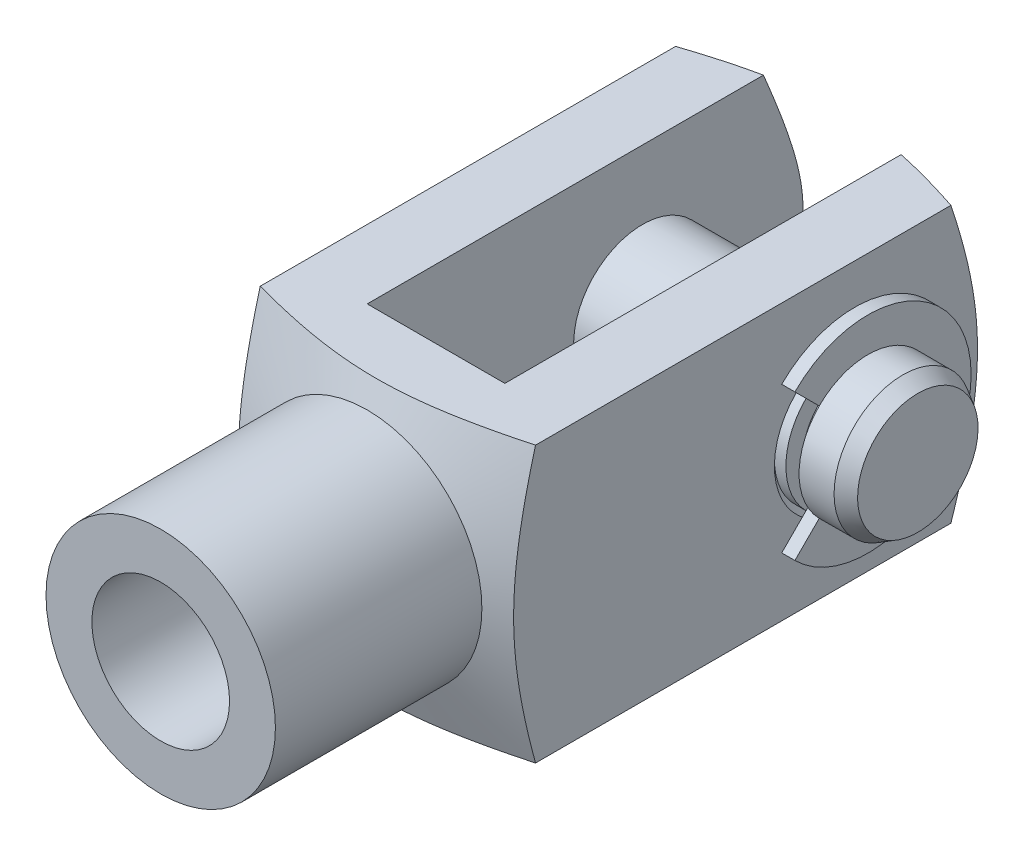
ISO-10303-21;
HEADER;
FILE_DESCRIPTION(('STEP AP214'),'2;1');
FILE_NAME('part.step','',(''),(''),'','','');
FILE_SCHEMA(('AUTOMOTIVE_DESIGN { 1 0 10303 214 1 1 1 1 }'));
ENDSEC;
DATA;
#1=APPLICATION_CONTEXT('core data for automotive mechanical design processes');
#2=APPLICATION_PROTOCOL_DEFINITION('international standard','automotive_design',2000,#1);
#3=PRODUCT_CONTEXT('',#1,'mechanical');
#4=PRODUCT('Part','Part','',(#3));
#5=PRODUCT_RELATED_PRODUCT_CATEGORY('part','',(#4));
#6=PRODUCT_DEFINITION_FORMATION('','',#4);
#7=PRODUCT_DEFINITION_CONTEXT('part definition',#1,'design');
#8=PRODUCT_DEFINITION('design','',#6,#7);
#9=PRODUCT_DEFINITION_SHAPE('','',#8);
#10=(LENGTH_UNIT() NAMED_UNIT(*) SI_UNIT(.MILLI.,.METRE.));
#11=(NAMED_UNIT(*) PLANE_ANGLE_UNIT() SI_UNIT($,.RADIAN.));
#12=(NAMED_UNIT(*) SI_UNIT($,.STERADIAN.) SOLID_ANGLE_UNIT());
#13=UNCERTAINTY_MEASURE_WITH_UNIT(LENGTH_MEASURE(1.E-05),#10,'distance_accuracy_value','');
#14=(GEOMETRIC_REPRESENTATION_CONTEXT(3) GLOBAL_UNCERTAINTY_ASSIGNED_CONTEXT((#13)) GLOBAL_UNIT_ASSIGNED_CONTEXT((#10,
#11,#12)) REPRESENTATION_CONTEXT('',''));
#15=CARTESIAN_POINT('',(0.,0.,0.));
#16=DIRECTION('',(0.,0.,1.));
#17=DIRECTION('',(1.,0.,0.));
#18=AXIS2_PLACEMENT_3D('',#15,#16,#17);
#19=CARTESIAN_POINT('',(13.65,0.,0.));
#20=DIRECTION('',(1.,0.,0.));
#21=DIRECTION('',(0.,-1.,0.));
#22=AXIS2_PLACEMENT_3D('',#19,#20,#21);
#23=PLANE('',#22);
#24=DIRECTION('',(0.,-0.707106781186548,-0.707106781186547));
#25=VECTOR('',#24,1.);
#26=CARTESIAN_POINT('',(13.65,9.54594154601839,9.54594154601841));
#27=LINE('',#26,#25);
#28=CARTESIAN_POINT('',(13.65,6.36396103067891,6.36396103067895));
#29=VERTEX_POINT('',#28);
#30=CARTESIAN_POINT('',(13.65,4.24264068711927,4.2426406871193));
#31=VERTEX_POINT('',#30);
#32=EDGE_CURVE('E174',#29,#31,#27,.T.);
#33=ORIENTED_EDGE('',*,*,#32,.T.);
#34=CARTESIAN_POINT('',(13.65,0.,0.));
#35=DIRECTION('',(1.,0.,0.));
#36=DIRECTION('',(0.,-1.,0.));
#37=AXIS2_PLACEMENT_3D('',#34,#35,#36);
#38=CIRCLE('',#37,6.);
#39=CARTESIAN_POINT('',(13.65,-4.24264068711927,4.2426406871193));
#40=VERTEX_POINT('',#39);
#41=EDGE_CURVE('E9',#31,#40,#38,.F.);
#42=ORIENTED_EDGE('',*,*,#41,.T.);
#43=DIRECTION('',(0.,-0.707106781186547,0.707106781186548));
#44=VECTOR('',#43,1.);
#45=CARTESIAN_POINT('',(13.65,-3.18198051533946,3.1819805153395));
#46=LINE('',#45,#44);
#47=CARTESIAN_POINT('',(13.65,-6.36396103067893,6.36396103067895));
#48=VERTEX_POINT('',#47);
#49=EDGE_CURVE('E181',#40,#48,#46,.T.);
#50=ORIENTED_EDGE('',*,*,#49,.T.);
#51=CARTESIAN_POINT('',(13.65,0.,0.));
#52=DIRECTION('',(-1.,0.,0.));
#53=DIRECTION('',(0.,1.,0.));
#54=AXIS2_PLACEMENT_3D('',#51,#52,#53);
#55=CIRCLE('',#54,9.);
#56=EDGE_CURVE('E178',#29,#48,#55,.T.);
#57=ORIENTED_EDGE('',*,*,#56,.F.);
#58=EDGE_LOOP('',(#33,#42,#50,#57));
#59=FACE_BOUND('',#58,.T.);
#60=ADVANCED_FACE('F15',(#59),#23,.T.);
#61=CARTESIAN_POINT('',(12.5,-3.18198051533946,3.1819805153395));
#62=DIRECTION('',(0.,-0.707106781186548,-0.707106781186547));
#63=DIRECTION('',(0.,-0.707106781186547,0.707106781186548));
#64=AXIS2_PLACEMENT_3D('',#61,#62,#63);
#65=PLANE('',#64);
#66=CARTESIAN_POINT('',(13.65,-3.18198051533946,3.1819805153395));
#67=VERTEX_POINT('',#66);
#68=EDGE_CURVE('E116',#67,#40,#46,.T.);
#69=ORIENTED_EDGE('',*,*,#68,.F.);
#70=DIRECTION('',(-1.,0.,0.));
#71=VECTOR('',#70,1.);
#72=CARTESIAN_POINT('',(12.5,-3.18198051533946,3.1819805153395));
#73=LINE('',#72,#71);
#74=CARTESIAN_POINT('',(12.5,-3.18198051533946,3.1819805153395));
#75=VERTEX_POINT('',#74);
#76=EDGE_CURVE('E179',#75,#67,#73,.F.);
#77=ORIENTED_EDGE('',*,*,#76,.F.);
#78=DIRECTION('',(0.,-0.707106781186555,0.70710678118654));
#79=VECTOR('',#78,1.);
#80=CARTESIAN_POINT('',(12.5,-3.18198051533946,3.1819805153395));
#81=LINE('',#80,#79);
#82=CARTESIAN_POINT('',(12.5,-4.24264068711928,4.2426406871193));
#83=VERTEX_POINT('',#82);
#84=EDGE_CURVE('E169',#75,#83,#81,.T.);
#85=ORIENTED_EDGE('',*,*,#84,.T.);
#86=CARTESIAN_POINT('',(12.5,-6.36396103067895,6.36396103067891));
#87=VERTEX_POINT('',#86);
#88=EDGE_CURVE('E151',#83,#87,#81,.T.);
#89=ORIENTED_EDGE('',*,*,#88,.T.);
#90=DIRECTION('',(-1.,0.,0.));
#91=VECTOR('',#90,1.);
#92=CARTESIAN_POINT('',(12.5,-6.36396103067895,6.36396103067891));
#93=LINE('',#92,#91);
#94=EDGE_CURVE('E175',#48,#87,#93,.T.);
#95=ORIENTED_EDGE('',*,*,#94,.F.);
#96=ORIENTED_EDGE('',*,*,#49,.F.);
#97=EDGE_LOOP('',(#69,#77,#85,#89,#95,#96));
#98=FACE_BOUND('',#97,.T.);
#99=ADVANCED_FACE('F387',(#98),#65,.F.);
#100=CARTESIAN_POINT('',(12.5,0.,0.));
#101=DIRECTION('',(-1.,0.,0.));
#102=DIRECTION('',(0.,1.,0.));
#103=AXIS2_PLACEMENT_3D('',#100,#101,#102);
#104=CYLINDRICAL_SURFACE('',#103,9.);
#105=DIRECTION('',(-1.,0.,0.));
#106=VECTOR('',#105,1.);
#107=CARTESIAN_POINT('',(12.5,6.36396103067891,6.36396103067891));
#108=LINE('',#107,#106);
#109=CARTESIAN_POINT('',(12.5,6.36396103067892,6.36396103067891));
#110=VERTEX_POINT('',#109);
#111=EDGE_CURVE('E167',#110,#29,#108,.F.);
#112=ORIENTED_EDGE('',*,*,#111,.T.);
#113=ORIENTED_EDGE('',*,*,#56,.T.);
#114=ORIENTED_EDGE('',*,*,#94,.T.);
#115=CARTESIAN_POINT('',(12.5,0.,0.));
#116=DIRECTION('',(-1.,0.,0.));
#117=DIRECTION('',(0.,1.,0.));
#118=AXIS2_PLACEMENT_3D('',#115,#116,#117);
#119=CIRCLE('',#118,9.);
#120=EDGE_CURVE('E161',#87,#110,#119,.F.);
#121=ORIENTED_EDGE('',*,*,#120,.T.);
#122=EDGE_LOOP('',(#112,#113,#114,#121));
#123=FACE_BOUND('',#122,.T.);
#124=ADVANCED_FACE('F392',(#123),#104,.T.);
#125=CARTESIAN_POINT('',(12.5,9.54594154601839,9.54594154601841));
#126=DIRECTION('',(0.,0.707106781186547,-0.707106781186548));
#127=DIRECTION('',(0.,-0.707106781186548,-0.707106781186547));
#128=AXIS2_PLACEMENT_3D('',#125,#126,#127);
#129=PLANE('',#128);
#130=DIRECTION('',(0.,-0.707106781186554,-0.707106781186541));
#131=VECTOR('',#130,1.);
#132=CARTESIAN_POINT('',(12.5,6.36396103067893,6.36396103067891));
#133=LINE('',#132,#131);
#134=CARTESIAN_POINT('',(12.5,4.24264068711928,4.2426406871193));
#135=VERTEX_POINT('',#134);
#136=EDGE_CURVE('E149',#110,#135,#133,.T.);
#137=ORIENTED_EDGE('',*,*,#136,.T.);
#138=CARTESIAN_POINT('',(12.5,3.18198051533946,3.1819805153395));
#139=VERTEX_POINT('',#138);
#140=EDGE_CURVE('E155',#135,#139,#133,.T.);
#141=ORIENTED_EDGE('',*,*,#140,.T.);
#142=DIRECTION('',(-1.,0.,0.));
#143=VECTOR('',#142,1.);
#144=CARTESIAN_POINT('',(12.5,3.18198051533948,3.1819805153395));
#145=LINE('',#144,#143);
#146=CARTESIAN_POINT('',(13.65,3.18198051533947,3.1819805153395));
#147=VERTEX_POINT('',#146);
#148=EDGE_CURVE('E172',#147,#139,#145,.T.);
#149=ORIENTED_EDGE('',*,*,#148,.F.);
#150=EDGE_CURVE('E184',#31,#147,#27,.T.);
#151=ORIENTED_EDGE('',*,*,#150,.F.);
#152=ORIENTED_EDGE('',*,*,#32,.F.);
#153=ORIENTED_EDGE('',*,*,#111,.F.);
#154=EDGE_LOOP('',(#137,#141,#149,#151,#152,#153));
#155=FACE_BOUND('',#154,.T.);
#156=ADVANCED_FACE('F164',(#155),#129,.F.);
#157=CARTESIAN_POINT('',(12.5,0.,0.));
#158=DIRECTION('',(1.,0.,0.));
#159=DIRECTION('',(0.,-1.,0.));
#160=AXIS2_PLACEMENT_3D('',#157,#158,#159);
#161=PLANE('',#160);
#162=CARTESIAN_POINT('',(12.5,0.,0.));
#163=DIRECTION('',(1.,0.,0.));
#164=DIRECTION('',(0.,0.,-1.));
#165=AXIS2_PLACEMENT_3D('',#162,#163,#164);
#166=CIRCLE('',#165,6.);
#167=EDGE_CURVE('E25',#83,#135,#166,.T.);
#168=ORIENTED_EDGE('',*,*,#167,.T.);
#169=ORIENTED_EDGE('',*,*,#136,.F.);
#170=ORIENTED_EDGE('',*,*,#120,.F.);
#171=ORIENTED_EDGE('',*,*,#88,.F.);
#172=EDGE_LOOP('',(#168,#169,#170,#171));
#173=FACE_BOUND('',#172,.T.);
#174=ADVANCED_FACE('F146',(#173),#161,.F.);
#175=CARTESIAN_POINT('',(-15.,0.,3.5));
#176=DIRECTION('',(-1.,0.,0.));
#177=DIRECTION('',(0.,1.,0.));
#178=AXIS2_PLACEMENT_3D('',#175,#176,#177);
#179=PLANE('',#178);
#180=CARTESIAN_POINT('',(-15.,0.,0.));
#181=DIRECTION('',(1.,0.,0.));
#182=DIRECTION('',(0.,-1.,0.));
#183=AXIS2_PLACEMENT_3D('',#180,#181,#182);
#184=CIRCLE('',#183,7.);
#185=CARTESIAN_POINT('',(-15.,-7.,0.));
#186=VERTEX_POINT('',#185);
#187=EDGE_CURVE('E458',#186,#186,#184,.T.);
#188=ORIENTED_EDGE('',*,*,#187,.F.);
#189=EDGE_LOOP('',(#188));
#190=FACE_BOUND('',#189,.T.);
#191=ADVANCED_FACE('F404',(#190),#179,.T.);
#192=CARTESIAN_POINT('',(-13.5,0.,0.));
#193=DIRECTION('',(1.,0.,0.));
#194=DIRECTION('',(0.,-1.,0.));
#195=AXIS2_PLACEMENT_3D('',#192,#193,#194);
#196=CONICAL_SURFACE('',#195,8.5,0.785398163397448);
#197=ORIENTED_EDGE('',*,*,#187,.T.);
#198=EDGE_LOOP('',(#197));
#199=FACE_BOUND('',#198,.T.);
#200=CARTESIAN_POINT('',(-13.5,0.,0.));
#201=DIRECTION('',(1.,0.,0.));
#202=DIRECTION('',(0.,-1.,0.));
#203=AXIS2_PLACEMENT_3D('',#200,#201,#202);
#204=CIRCLE('',#203,8.5);
#205=CARTESIAN_POINT('',(-13.5,-8.5,0.));
#206=VERTEX_POINT('',#205);
#207=EDGE_CURVE('E463',#206,#206,#204,.T.);
#208=ORIENTED_EDGE('',*,*,#207,.F.);
#209=EDGE_LOOP('',(#208));
#210=FACE_BOUND('',#209,.T.);
#211=ADVANCED_FACE('F381',(#199,#210),#196,.T.);
#212=CARTESIAN_POINT('',(0.,5.,48.));
#213=DIRECTION('',(0.,0.,1.));
#214=DIRECTION('',(1.,0.,0.));
#215=AXIS2_PLACEMENT_3D('',#212,#213,#214);
#216=PLANE('',#215);
#217=CARTESIAN_POINT('',(0.,0.,48.));
#218=DIRECTION('',(0.,0.,1.));
#219=DIRECTION('',(1.,0.,0.));
#220=AXIS2_PLACEMENT_3D('',#217,#218,#219);
#221=CIRCLE('',#220,10.);
#222=CARTESIAN_POINT('',(10.,0.,48.));
#223=VERTEX_POINT('',#222);
#224=EDGE_CURVE('E252',#223,#223,#221,.F.);
#225=ORIENTED_EDGE('',*,*,#224,.F.);
#226=EDGE_LOOP('',(#225));
#227=FACE_BOUND('',#226,.T.);
#228=CARTESIAN_POINT('',(0.,0.,47.9999999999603));
#229=DIRECTION('',(0.,0.,1.));
#230=DIRECTION('',(1.,0.,0.));
#231=AXIS2_PLACEMENT_3D('',#228,#229,#230);
#232=CIRCLE('',#231,6.00000000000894);
#233=CARTESIAN_POINT('',(6.00000000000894,0.,47.9999999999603));
#234=VERTEX_POINT('',#233);
#235=EDGE_CURVE('E141',#234,#234,#232,.F.);
#236=ORIENTED_EDGE('',*,*,#235,.T.);
#237=EDGE_LOOP('',(#236));
#238=FACE_BOUND('',#237,.T.);
#239=ADVANCED_FACE('F378',(#227,#238),#216,.T.);
#240=CARTESIAN_POINT('',(-12.75,0.,0.));
#241=DIRECTION('',(1.,0.,0.));
#242=DIRECTION('',(0.,-1.,0.));
#243=AXIS2_PLACEMENT_3D('',#240,#241,#242);
#244=CYLINDRICAL_SURFACE('',#243,8.5);
#245=ORIENTED_EDGE('',*,*,#207,.T.);
#246=EDGE_LOOP('',(#245));
#247=FACE_BOUND('',#246,.T.);
#248=CARTESIAN_POINT('',(-12.,0.,0.));
#249=DIRECTION('',(1.,0.,0.));
#250=DIRECTION('',(0.,-1.,0.));
#251=AXIS2_PLACEMENT_3D('',#248,#249,#250);
#252=CIRCLE('',#251,8.5);
#253=CARTESIAN_POINT('',(-12.,-8.5,0.));
#254=VERTEX_POINT('',#253);
#255=EDGE_CURVE('E182',#254,#254,#252,.T.);
#256=ORIENTED_EDGE('',*,*,#255,.F.);
#257=EDGE_LOOP('',(#256));
#258=FACE_BOUND('',#257,.T.);
#259=ADVANCED_FACE('F365',(#247,#258),#244,.T.);
#260=CARTESIAN_POINT('',(0.,0.,7.02943725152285));
#261=DIRECTION('',(0.,0.,1.));
#262=DIRECTION('',(1.,0.,0.));
#263=AXIS2_PLACEMENT_3D('',#260,#261,#262);
#264=CYLINDRICAL_SURFACE('',#263,6.);
#265=CARTESIAN_POINT('',(0.,0.,24.0000000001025));
#266=DIRECTION('',(0.,0.,-1.));
#267=DIRECTION('',(-1.,0.,0.));
#268=AXIS2_PLACEMENT_3D('',#265,#266,#267);
#269=CIRCLE('',#268,6.00000000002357);
#270=CARTESIAN_POINT('',(-6.,0.,24.));
#271=VERTEX_POINT('',#270);
#272=CARTESIAN_POINT('',(6.00000000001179,0.,24.0000000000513));
#273=VERTEX_POINT('',#272);
#274=EDGE_CURVE('E484',#271,#273,#269,.T.);
#275=ORIENTED_EDGE('',*,*,#274,.T.);
#276=CARTESIAN_POINT('',(0.,0.,24.0000000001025));
#277=DIRECTION('',(0.,0.,-1.));
#278=DIRECTION('',(-1.,0.,0.));
#279=AXIS2_PLACEMENT_3D('',#276,#277,#278);
#280=CIRCLE('',#279,6.00000000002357);
#281=EDGE_CURVE('E233',#273,#271,#280,.T.);
#282=ORIENTED_EDGE('',*,*,#281,.T.);
#283=EDGE_LOOP('',(#275,#282));
#284=FACE_BOUND('',#283,.T.);
#285=ORIENTED_EDGE('',*,*,#235,.F.);
#286=EDGE_LOOP('',(#285));
#287=FACE_BOUND('',#286,.T.);
#288=ADVANCED_FACE('F357',(#284,#287),#264,.F.);
#289=CARTESIAN_POINT('',(0.5,0.,0.));
#290=DIRECTION('',(1.,0.,0.));
#291=DIRECTION('',(0.,-1.,0.));
#292=AXIS2_PLACEMENT_3D('',#289,#290,#291);
#293=CYLINDRICAL_SURFACE('',#292,6.);
#294=CARTESIAN_POINT('',(-6.,0.,0.));
#295=DIRECTION('',(1.,0.,0.));
#296=DIRECTION('',(0.,-1.,0.));
#297=AXIS2_PLACEMENT_3D('',#294,#295,#296);
#298=CIRCLE('',#297,6.);
#299=CARTESIAN_POINT('',(-6.,-6.,0.));
#300=VERTEX_POINT('',#299);
#301=EDGE_CURVE('E227',#300,#300,#298,.T.);
#302=ORIENTED_EDGE('',*,*,#301,.T.);
#303=EDGE_LOOP('',(#302));
#304=FACE_BOUND('',#303,.T.);
#305=CARTESIAN_POINT('',(6.,0.,0.));
#306=DIRECTION('',(1.,0.,0.));
#307=DIRECTION('',(0.,-1.,0.));
#308=AXIS2_PLACEMENT_3D('',#305,#306,#307);
#309=CIRCLE('',#308,6.);
#310=CARTESIAN_POINT('',(6.,-6.,0.));
#311=VERTEX_POINT('',#310);
#312=EDGE_CURVE('E237',#311,#311,#309,.F.);
#313=ORIENTED_EDGE('',*,*,#312,.T.);
#314=EDGE_LOOP('',(#313));
#315=FACE_BOUND('',#314,.T.);
#316=ADVANCED_FACE('F396',(#304,#315),#293,.T.);
#317=CARTESIAN_POINT('',(-6.,40.,24.));
#318=DIRECTION('',(0.,0.,1.));
#319=DIRECTION('',(1.,0.,0.));
#320=AXIS2_PLACEMENT_3D('',#317,#318,#319);
#321=PLANE('',#320);
#322=ORIENTED_EDGE('',*,*,#281,.F.);
#323=DIRECTION('',(0.,1.,0.));
#324=VECTOR('',#323,1.);
#325=CARTESIAN_POINT('',(6.,40.,24.));
#326=LINE('',#325,#324);
#327=CARTESIAN_POINT('',(6.,-12.,24.));
#328=VERTEX_POINT('',#327);
#329=EDGE_CURVE('E230',#328,#273,#326,.T.);
#330=ORIENTED_EDGE('',*,*,#329,.F.);
#331=DIRECTION('',(1.,0.,0.));
#332=VECTOR('',#331,1.);
#333=CARTESIAN_POINT('',(-40.,-12.,24.));
#334=LINE('',#333,#332);
#335=CARTESIAN_POINT('',(-6.,-12.,24.));
#336=VERTEX_POINT('',#335);
#337=EDGE_CURVE('E205',#328,#336,#334,.F.);
#338=ORIENTED_EDGE('',*,*,#337,.T.);
#339=DIRECTION('',(0.,1.,0.));
#340=VECTOR('',#339,1.);
#341=CARTESIAN_POINT('',(-6.,40.,24.));
#342=LINE('',#341,#340);
#343=EDGE_CURVE('E223',#336,#271,#342,.T.);
#344=ORIENTED_EDGE('',*,*,#343,.T.);
#345=EDGE_LOOP('',(#322,#330,#338,#344));
#346=FACE_BOUND('',#345,.T.);
#347=ADVANCED_FACE('F277',(#346),#321,.F.);
#348=CARTESIAN_POINT('',(0.,0.,39.));
#349=DIRECTION('',(0.,0.,1.));
#350=DIRECTION('',(1.,0.,0.));
#351=AXIS2_PLACEMENT_3D('',#348,#349,#350);
#352=CYLINDRICAL_SURFACE('',#351,10.);
#353=ORIENTED_EDGE('',*,*,#224,.T.);
#354=EDGE_LOOP('',(#353));
#355=FACE_BOUND('',#354,.T.);
#356=CARTESIAN_POINT('',(0.,0.,30.));
#357=DIRECTION('',(0.,0.,-1.));
#358=DIRECTION('',(0.,1.,0.));
#359=AXIS2_PLACEMENT_3D('',#356,#357,#358);
#360=CIRCLE('',#359,10.);
#361=CARTESIAN_POINT('',(0.,10.,30.));
#362=VERTEX_POINT('',#361);
#363=EDGE_CURVE('E242',#362,#362,#360,.T.);
#364=ORIENTED_EDGE('',*,*,#363,.F.);
#365=EDGE_LOOP('',(#364));
#366=FACE_BOUND('',#365,.T.);
#367=ADVANCED_FACE('F398',(#355,#366),#352,.T.);
#368=CARTESIAN_POINT('',(-12.,40.,72.));
#369=DIRECTION('',(1.,0.,0.));
#370=DIRECTION('',(0.,-1.,0.));
#371=AXIS2_PLACEMENT_3D('',#368,#369,#370);
#372=PLANE('',#371);
#373=ORIENTED_EDGE('',*,*,#255,.T.);
#374=EDGE_LOOP('',(#373));
#375=FACE_BOUND('',#374,.T.);
#376=CARTESIAN_POINT('',(-12.,11.999999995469,27.3242516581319));
#377=CARTESIAN_POINT('',(-12.,11.7134935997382,27.4020115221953));
#378=CARTESIAN_POINT('',(-12.,11.4266355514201,27.4784887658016));
#379=CARTESIAN_POINT('',(-12.,10.852144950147,27.6285250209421));
#380=CARTESIAN_POINT('',(-12.,10.5645123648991,27.7020839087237));
#381=CARTESIAN_POINT('',(-12.,9.98826797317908,27.8459632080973));
#382=CARTESIAN_POINT('',(-12.,9.69965571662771,27.9162818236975));
#383=CARTESIAN_POINT('',(-12.,9.12156037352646,28.0532202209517));
#384=CARTESIAN_POINT('',(-12.,8.8320772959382,28.1198400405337));
#385=CARTESIAN_POINT('',(-12.,7.95916037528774,28.3141659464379));
#386=CARTESIAN_POINT('',(-12.,7.37429740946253,28.4355699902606));
#387=CARTESIAN_POINT('',(-12.,6.20064756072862,28.6573664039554));
#388=CARTESIAN_POINT('',(-12.,5.61186125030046,28.7577617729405));
#389=CARTESIAN_POINT('',(-12.,4.44683234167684,28.9303687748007));
#390=CARTESIAN_POINT('',(-12.,3.87069716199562,29.0032875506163));
#391=CARTESIAN_POINT('',(-12.,3.00434377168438,29.0913059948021));
#392=CARTESIAN_POINT('',(-12.,2.7151900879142,29.1170860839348));
#393=CARTESIAN_POINT('',(-12.,2.13631395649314,29.1611123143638));
#394=CARTESIAN_POINT('',(-12.,1.84659153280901,29.1793587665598));
#395=CARTESIAN_POINT('',(-12.,1.26750836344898,29.2079553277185));
#396=CARTESIAN_POINT('',(-12.,0.978148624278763,29.2183257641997));
#397=CARTESIAN_POINT('',(-12.,0.399262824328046,29.23105784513));
#398=CARTESIAN_POINT('',(-12.,0.109736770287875,29.2334197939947));
#399=CARTESIAN_POINT('',(-12.,-0.469266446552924,29.2300903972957));
#400=CARTESIAN_POINT('',(-12.,-0.758743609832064,29.2243991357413));
#401=CARTESIAN_POINT('',(-12.,-1.33742362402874,29.2050725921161));
#402=CARTESIAN_POINT('',(-12.,-1.62662647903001,29.1914374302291));
#403=CARTESIAN_POINT('',(-12.,-2.33807462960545,29.1483825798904));
#404=CARTESIAN_POINT('',(-12.,-2.76005981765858,29.1145808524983));
#405=CARTESIAN_POINT('',(-12.,-3.60248423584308,29.0317186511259));
#406=CARTESIAN_POINT('',(-12.,-4.02292353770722,28.9826588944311));
#407=CARTESIAN_POINT('',(-12.,-4.8626849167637,28.8707466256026));
#408=CARTESIAN_POINT('',(-12.,-5.28200381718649,28.807870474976));
#409=CARTESIAN_POINT('',(-12.,-6.118644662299,28.6700714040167));
#410=CARTESIAN_POINT('',(-12.,-6.5359665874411,28.595148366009));
#411=CARTESIAN_POINT('',(-12.,-7.37753483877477,28.4332053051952));
#412=CARTESIAN_POINT('',(-12.,-7.80173756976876,28.3459601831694));
#413=CARTESIAN_POINT('',(-12.,-8.64815153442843,28.1622698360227));
#414=CARTESIAN_POINT('',(-12.,-9.07036269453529,28.0658242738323));
#415=CARTESIAN_POINT('',(-12.,-9.91146421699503,27.8655321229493));
#416=CARTESIAN_POINT('',(-12.,-10.3303610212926,27.7617124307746));
#417=CARTESIAN_POINT('',(-12.,-11.1664201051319,27.5475691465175));
#418=CARTESIAN_POINT('',(-12.,-11.5835826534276,27.4372466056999));
#419=CARTESIAN_POINT('',(-12.,-11.9999999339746,27.3242516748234));
#420=B_SPLINE_CURVE_WITH_KNOTS('',3,(#376,#377,#378,#379,#380,#381,#382,#383,#384,#385,#386,
#387,#388,#389,#390,#391,#392,#393,#394,#395,#396,#397,#398,#399,#400,#401,#402,#403,#404,#405,
#406,#407,#408,#409,#410,#411,#412,#413,#414,#415,#416,#417,#418,#419),.UNSPECIFIED.,.F.,.F.,(4,
2,2,2,2,2,2,2,2,2,2,2,2,2,2,2,2,2,2,2,2,4),(0.,0.890615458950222,1.78126864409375,
2.67240969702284,3.56354161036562,5.35520514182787,7.14661272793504,8.88812209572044,
9.75894149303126,10.6297249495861,11.4982532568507,12.3667485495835,13.2352347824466,
14.1037078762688,15.3733967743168,16.6430259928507,17.9148445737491,19.1866755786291,
20.4858004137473,21.7849728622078,23.0796285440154,24.3740754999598),.UNSPECIFIED.);
#421=CARTESIAN_POINT('',(-12.,11.9999999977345,27.3242516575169));
#422=VERTEX_POINT('',#421);
#423=CARTESIAN_POINT('',(-11.9999999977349,-11.9999999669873,27.3242516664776));
#424=VERTEX_POINT('',#423);
#425=EDGE_CURVE('E248',#422,#424,#420,.T.);
#426=ORIENTED_EDGE('',*,*,#425,.F.);
#427=DIRECTION('',(0.,0.,-1.));
#428=VECTOR('',#427,1.);
#429=CARTESIAN_POINT('',(-12.,12.,-26.4));
#430=LINE('',#429,#428);
#431=CARTESIAN_POINT('',(-12.,12.,-8.8843425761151));
#432=VERTEX_POINT('',#431);
#433=EDGE_CURVE('E219',#422,#432,#430,.T.);
#434=ORIENTED_EDGE('',*,*,#433,.T.);
#435=CARTESIAN_POINT('',(-12.,-12.,-8.8843425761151));
#436=CARTESIAN_POINT('',(-12.,-11.7615514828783,-8.96296266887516));
#437=CARTESIAN_POINT('',(-12.,-11.5227570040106,-9.04053231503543));
#438=CARTESIAN_POINT('',(-12.,-11.0444126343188,-9.19333234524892));
#439=CARTESIAN_POINT('',(-12.,-10.8048627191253,-9.26856265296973));
#440=CARTESIAN_POINT('',(-12.,-10.084824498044,-9.4904359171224));
#441=CARTESIAN_POINT('',(-12.,-9.60312991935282,-9.63320074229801));
#442=CARTESIAN_POINT('',(-12.,-8.63271726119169,-9.90699968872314));
#443=CARTESIAN_POINT('',(-12.,-8.14397360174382,-10.0379436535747));
#444=CARTESIAN_POINT('',(-12.,-7.16253980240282,-10.2840294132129));
#445=CARTESIAN_POINT('',(-12.,-6.66985006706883,-10.3991728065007));
#446=CARTESIAN_POINT('',(-12.,-5.69773118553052,-10.6065852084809));
#447=CARTESIAN_POINT('',(-12.,-5.21844460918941,-10.699515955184));
#448=CARTESIAN_POINT('',(-12.,-4.25621361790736,-10.8642713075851));
#449=CARTESIAN_POINT('',(-12.,-3.77326922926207,-10.9360960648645));
#450=CARTESIAN_POINT('',(-12.,-2.80602754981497,-11.055305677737));
#451=CARTESIAN_POINT('',(-12.,-2.32174075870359,-11.1027744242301));
#452=CARTESIAN_POINT('',(-12.,-1.35128490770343,-11.1712295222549));
#453=CARTESIAN_POINT('',(-12.,-0.865115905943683,-11.1922166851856));
#454=CARTESIAN_POINT('',(-12.,0.138040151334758,-11.2069657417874));
#455=CARTESIAN_POINT('',(-12.,0.655054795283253,-11.1989446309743));
#456=CARTESIAN_POINT('',(-12.,1.68768885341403,-11.1521710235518));
#457=CARTESIAN_POINT('',(-12.,2.20330818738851,-11.1134167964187));
#458=CARTESIAN_POINT('',(-12.,3.23350509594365,-11.0073263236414));
#459=CARTESIAN_POINT('',(-12.,3.7480714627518,-10.9398831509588));
#460=CARTESIAN_POINT('',(-12.,4.7732414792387,-10.7799425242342));
#461=CARTESIAN_POINT('',(-12.,5.28384506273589,-10.6874446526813));
#462=CARTESIAN_POINT('',(-12.,6.32030071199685,-10.4773572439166));
#463=CARTESIAN_POINT('',(-12.,6.8459827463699,-10.3589385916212));
#464=CARTESIAN_POINT('',(-12.,7.89282563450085,-10.1034858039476));
#465=CARTESIAN_POINT('',(-12.,8.41398589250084,-9.96644925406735));
#466=CARTESIAN_POINT('',(-12.,9.44815672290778,-9.67848855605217));
#467=CARTESIAN_POINT('',(-12.,9.96119913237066,-9.52767798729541));
#468=CARTESIAN_POINT('',(-12.,10.7278813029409,-9.29260310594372));
#469=CARTESIAN_POINT('',(-12.,10.9828998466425,-9.21278888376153));
#470=CARTESIAN_POINT('',(-12.,11.4920760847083,-9.0504934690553));
#471=CARTESIAN_POINT('',(-12.,11.7462338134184,-8.96801238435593));
#472=CARTESIAN_POINT('',(-12.,12.,-8.8843425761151));
#473=B_SPLINE_CURVE_WITH_KNOTS('',3,(#435,#436,#437,#438,#439,#440,#441,#442,#443,#444,#445,
#446,#447,#448,#449,#450,#451,#452,#453,#454,#455,#456,#457,#458,#459,#460,#461,#462,#463,#464,
#465,#466,#467,#468,#469,#470,#471,#472),.UNSPECIFIED.,.F.,.F.,(4,2,2,2,2,2,2,2,2,2,2,2,2,2,2,2,
2,2,4),(0.,0.75322144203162,1.50646743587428,3.01353524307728,4.53126725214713,6.04884560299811,
7.51308460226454,8.97731308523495,10.4364637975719,11.8955698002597,13.4458427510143,
14.9962030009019,16.5523929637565,18.1086088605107,19.7247556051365,21.3411121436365,
22.945172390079,23.7468109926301,24.5484172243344),.UNSPECIFIED.);
#474=CARTESIAN_POINT('',(-12.,-12.,-8.8843425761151));
#475=VERTEX_POINT('',#474);
#476=EDGE_CURVE('E325',#475,#432,#473,.T.);
#477=ORIENTED_EDGE('',*,*,#476,.F.);
#478=DIRECTION('',(0.,0.,-1.));
#479=VECTOR('',#478,1.);
#480=CARTESIAN_POINT('',(-12.,-12.,35.6));
#481=LINE('',#480,#479);
#482=EDGE_CURVE('E197',#475,#424,#481,.F.);
#483=ORIENTED_EDGE('',*,*,#482,.T.);
#484=EDGE_LOOP('',(#426,#434,#477,#483));
#485=FACE_BOUND('',#484,.T.);
#486=ADVANCED_FACE('F316',(#375,#485),#372,.F.);
#487=CARTESIAN_POINT('',(0.,0.,-8.8536486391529));
#488=DIRECTION('',(0.,0.,1.));
#489=DIRECTION('',(1.,0.,0.));
#490=AXIS2_PLACEMENT_3D('',#487,#488,#489);
#491=CONICAL_SURFACE('',#490,17.0363861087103,1.13446401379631);
#492=CARTESIAN_POINT('',(-12.,12.,-8.8843425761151));
#493=CARTESIAN_POINT('',(-11.7534953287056,12.,-8.96561852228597));
#494=CARTESIAN_POINT('',(-11.5066205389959,12.,-9.04577252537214));
#495=CARTESIAN_POINT('',(-11.0120628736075,12.,-9.20357137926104));
#496=CARTESIAN_POINT('',(-10.7643799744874,12.,-9.28121615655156));
#497=CARTESIAN_POINT('',(-10.0204408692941,12.,-9.50985816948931));
#498=CARTESIAN_POINT('',(-9.52289518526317,12.,-9.65669559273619));
#499=CARTESIAN_POINT('',(-8.52379223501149,12.,-9.93669330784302));
#500=CARTESIAN_POINT('',(-8.0222339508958,12.,-10.069850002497));
#501=CARTESIAN_POINT('',(-7.26656094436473,12.,-10.2569377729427));
#502=CARTESIAN_POINT('',(-7.01401342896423,12.,-10.3172138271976));
#503=CARTESIAN_POINT('',(-6.50782719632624,12.,-10.4330759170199));
#504=CARTESIAN_POINT('',(-6.25418840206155,12.,-10.4886616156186));
#505=CARTESIAN_POINT('',(-6.,12.,-10.5416722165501));
#506=B_SPLINE_CURVE_WITH_KNOTS('',3,(#492,#493,#494,#495,#496,#497,#498,#499,#500,#501,#502,
#503,#504,#505),.UNSPECIFIED.,.F.,.F.,(4,2,2,2,2,2,4),(0.,0.778670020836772,1.55736283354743,
3.11348724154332,4.67001977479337,5.4489026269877,6.22784138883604),.UNSPECIFIED.);
#507=CARTESIAN_POINT('',(-6.,12.,-10.5416722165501));
#508=VERTEX_POINT('',#507);
#509=EDGE_CURVE('E218',#432,#508,#506,.T.);
#510=ORIENTED_EDGE('',*,*,#509,.T.);
#511=CARTESIAN_POINT('',(-6.,12.,-10.5416722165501));
#512=CARTESIAN_POINT('',(-6.,11.6471429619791,-10.6888012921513));
#513=CARTESIAN_POINT('',(-6.,11.2938461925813,-10.8348918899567));
#514=CARTESIAN_POINT('',(-6.,10.5860738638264,-11.1242897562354));
#515=CARTESIAN_POINT('',(-6.,10.2315981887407,-11.267596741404));
#516=CARTESIAN_POINT('',(-6.,9.51989833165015,-11.5512256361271));
#517=CARTESIAN_POINT('',(-6.,9.16266882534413,-11.6915342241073));
#518=CARTESIAN_POINT('',(-6.,8.44643866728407,-11.9675291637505));
#519=CARTESIAN_POINT('',(-6.,8.08743808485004,-12.1032156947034));
#520=CARTESIAN_POINT('',(-6.,7.36708914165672,-12.3685330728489));
#521=CARTESIAN_POINT('',(-6.00000000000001,7.00574019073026,-12.4981623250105));
#522=CARTESIAN_POINT('',(-6.00000000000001,6.28015184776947,-12.7492558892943));
#523=CARTESIAN_POINT('',(-6.,5.91591215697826,-12.8707193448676));
#524=CARTESIAN_POINT('',(-6.00000000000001,5.18431163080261,-13.1023759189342));
#525=CARTESIAN_POINT('',(-6.00000000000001,4.81695499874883,-13.2125822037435));
#526=CARTESIAN_POINT('',(-6.,4.07801834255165,-13.4177694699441));
#527=CARTESIAN_POINT('',(-6.,3.70643943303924,-13.5127543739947));
#528=CARTESIAN_POINT('',(-6.,3.13031971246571,-13.6431872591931));
#529=CARTESIAN_POINT('',(-6.,2.92743331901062,-13.6859447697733));
#530=CARTESIAN_POINT('',(-6.00000000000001,2.52029299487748,-13.7644256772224));
#531=CARTESIAN_POINT('',(-6.00000000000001,2.31603908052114,-13.8001491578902));
#532=CARTESIAN_POINT('',(-6.00000000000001,1.90638054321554,-13.8635516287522));
#533=CARTESIAN_POINT('',(-6.00000000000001,1.70097655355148,-13.8912346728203));
#534=CARTESIAN_POINT('',(-6.00000000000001,1.28916372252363,-13.9376634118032));
#535=CARTESIAN_POINT('',(-6.00000000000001,1.08275495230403,-13.9564097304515));
#536=CARTESIAN_POINT('',(-6.00000000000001,0.669628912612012,-13.98423999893));
#537=CARTESIAN_POINT('',(-6.00000000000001,0.462912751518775,-13.9933402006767));
#538=CARTESIAN_POINT('',(-6.00000000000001,0.0492803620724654,-14.0015649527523));
#539=CARTESIAN_POINT('',(-6.00000000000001,-0.157635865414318,-14.0006895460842));
#540=CARTESIAN_POINT('',(-6.00000000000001,-0.571165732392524,-13.9889999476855));
#541=CARTESIAN_POINT('',(-6.00000000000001,-0.777779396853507,-13.9781866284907));
#542=CARTESIAN_POINT('',(-6.,-1.19028084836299,-13.9470572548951));
#543=CARTESIAN_POINT('',(-6.,-1.39616863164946,-13.9267411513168));
#544=CARTESIAN_POINT('',(-6.,-1.82450113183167,-13.8752320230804));
#545=CARTESIAN_POINT('',(-6.,-2.04685087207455,-13.843255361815));
#546=CARTESIAN_POINT('',(-6.00000000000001,-2.49006140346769,-13.7701695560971));
#547=CARTESIAN_POINT('',(-6.00000000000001,-2.710921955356,-13.7290589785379));
#548=CARTESIAN_POINT('',(-6.00000000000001,-3.15117614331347,-13.6389515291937));
#549=CARTESIAN_POINT('',(-6.00000000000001,-3.37056863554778,-13.5899491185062));
#550=CARTESIAN_POINT('',(-6.00000000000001,-3.80774215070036,-13.4852984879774));
#551=CARTESIAN_POINT('',(-6.00000000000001,-4.02552323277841,-13.4296505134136));
#552=CARTESIAN_POINT('',(-6.00000000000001,-4.46076221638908,-13.312476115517));
#553=CARTESIAN_POINT('',(-6.00000000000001,-4.67821189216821,-13.2509193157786));
#554=CARTESIAN_POINT('',(-6.00000000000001,-5.11173752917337,-13.1231269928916));
#555=CARTESIAN_POINT('',(-6.00000000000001,-5.32781341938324,-13.0568912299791));
#556=CARTESIAN_POINT('',(-6.00000000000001,-5.75865139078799,-12.9205593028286));
#557=CARTESIAN_POINT('',(-6.00000000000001,-5.97341392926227,-12.8504645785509));
#558=CARTESIAN_POINT('',(-6.00000000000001,-6.40185619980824,-12.7070339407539));
#559=CARTESIAN_POINT('',(-6.00000000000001,-6.615535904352,-12.6336979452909));
#560=CARTESIAN_POINT('',(-6.00000000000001,-7.26826944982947,-12.4050597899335));
#561=CARTESIAN_POINT('',(-6.00000000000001,-7.70579069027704,-12.245383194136));
#562=CARTESIAN_POINT('',(-6.00000000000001,-8.57784130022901,-11.9180139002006));
#563=CARTESIAN_POINT('',(-6.00000000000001,-9.01237038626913,-11.7503204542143));
#564=CARTESIAN_POINT('',(-6.00000000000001,-9.87340601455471,-11.4114050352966));
#565=CARTESIAN_POINT('',(-6.00000000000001,-10.2999425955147,-11.2402591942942));
#566=CARTESIAN_POINT('',(-6.00000000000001,-10.9384154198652,-10.9804225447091));
#567=CARTESIAN_POINT('',(-6.00000000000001,-11.1509932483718,-10.8933009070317));
#568=CARTESIAN_POINT('',(-6.00000000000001,-11.5757687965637,-10.7181416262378));
#569=CARTESIAN_POINT('',(-6.00000000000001,-11.7879665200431,-10.6301039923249));
#570=CARTESIAN_POINT('',(-6.,-12.,-10.5416722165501));
#571=B_SPLINE_CURVE_WITH_KNOTS('',3,(#511,#512,#513,#514,#515,#516,#517,#518,#519,#520,#521,
#522,#523,#524,#525,#526,#527,#528,#529,#530,#531,#532,#533,#534,#535,#536,#537,#538,#539,#540,
#541,#542,#543,#544,#545,#546,#547,#548,#549,#550,#551,#552,#553,#554,#555,#556,#557,#558,#559,
#560,#561,#562,#563,#564,#565,#566,#567,#568,#569,#570),.UNSPECIFIED.,.F.,.F.,(4,2,2,2,2,2,2,2,
2,2,2,2,2,2,2,2,2,2,2,2,2,2,2,2,2,2,2,2,2,4),(0.,1.1469145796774,2.29394528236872,
3.44530904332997,4.59662809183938,5.74824862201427,6.89998976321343,8.05036802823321,
9.20044935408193,9.82237729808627,10.4442978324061,11.0659042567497,11.6874672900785,
12.3079814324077,12.9284928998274,13.5489498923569,14.1694100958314,14.8431021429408,
15.5168999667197,16.1911727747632,16.865420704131,17.5433422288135,18.2212985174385,
18.8990035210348,19.5767256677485,20.9738402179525,22.371085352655,23.7498278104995,
24.4390400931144,25.1282454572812),.UNSPECIFIED.);
#572=CARTESIAN_POINT('',(-6.,-12.,-10.5416722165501));
#573=VERTEX_POINT('',#572);
#574=EDGE_CURVE('E241',#508,#573,#571,.T.);
#575=ORIENTED_EDGE('',*,*,#574,.T.);
#576=CARTESIAN_POINT('',(-6.,-12.,-10.5416722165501));
#577=CARTESIAN_POINT('',(-6.25418840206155,-12.,-10.4886616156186));
#578=CARTESIAN_POINT('',(-6.50782719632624,-12.,-10.4330759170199));
#579=CARTESIAN_POINT('',(-7.01401342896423,-12.,-10.3172138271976));
#580=CARTESIAN_POINT('',(-7.26656094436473,-12.,-10.2569377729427));
#581=CARTESIAN_POINT('',(-8.0222339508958,-12.,-10.069850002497));
#582=CARTESIAN_POINT('',(-8.52379223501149,-12.,-9.93669330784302));
#583=CARTESIAN_POINT('',(-9.52289518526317,-12.,-9.65669559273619));
#584=CARTESIAN_POINT('',(-10.0204408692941,-12.,-9.50985816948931));
#585=CARTESIAN_POINT('',(-10.7643799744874,-12.,-9.28121615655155));
#586=CARTESIAN_POINT('',(-11.0120628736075,-12.,-9.20357137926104));
#587=CARTESIAN_POINT('',(-11.5066205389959,-12.,-9.04577252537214));
#588=CARTESIAN_POINT('',(-11.7534953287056,-12.,-8.96561852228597));
#589=CARTESIAN_POINT('',(-12.,-12.,-8.8843425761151));
#590=B_SPLINE_CURVE_WITH_KNOTS('',3,(#576,#577,#578,#579,#580,#581,#582,#583,#584,#585,#586,
#587,#588,#589),.UNSPECIFIED.,.F.,.F.,(4,2,2,2,2,2,4),(0.,0.778938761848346,1.55782161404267,
3.11435414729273,4.67047855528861,5.44917136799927,6.22784138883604),.UNSPECIFIED.);
#591=EDGE_CURVE('E201',#573,#475,#590,.T.);
#592=ORIENTED_EDGE('',*,*,#591,.T.);
#593=ORIENTED_EDGE('',*,*,#476,.T.);
#594=EDGE_LOOP('',(#510,#575,#592,#593));
#595=FACE_BOUND('',#594,.T.);
#596=ADVANCED_FACE('F310',(#595),#491,.T.);
#597=CARTESIAN_POINT('',(-6.,40.,-45.));
#598=DIRECTION('',(-1.,0.,0.));
#599=DIRECTION('',(0.,1.,0.));
#600=AXIS2_PLACEMENT_3D('',#597,#598,#599);
#601=PLANE('',#600);
#602=ORIENTED_EDGE('',*,*,#574,.F.);
#603=DIRECTION('',(0.,0.,-1.));
#604=VECTOR('',#603,1.);
#605=CARTESIAN_POINT('',(-6.,12.,-26.4));
#606=LINE('',#605,#604);
#607=CARTESIAN_POINT('',(-6.,12.,24.));
#608=VERTEX_POINT('',#607);
#609=EDGE_CURVE('E215',#508,#608,#606,.F.);
#610=ORIENTED_EDGE('',*,*,#609,.T.);
#611=DIRECTION('',(0.,1.,0.));
#612=VECTOR('',#611,1.);
#613=CARTESIAN_POINT('',(-6.,40.,24.));
#614=LINE('',#613,#612);
#615=EDGE_CURVE('E226',#271,#608,#614,.T.);
#616=ORIENTED_EDGE('',*,*,#615,.F.);
#617=ORIENTED_EDGE('',*,*,#343,.F.);
#618=DIRECTION('',(0.,0.,-1.));
#619=VECTOR('',#618,1.);
#620=CARTESIAN_POINT('',(-6.,-12.,35.6));
#621=LINE('',#620,#619);
#622=EDGE_CURVE('E202',#336,#573,#621,.T.);
#623=ORIENTED_EDGE('',*,*,#622,.T.);
#624=EDGE_LOOP('',(#602,#610,#616,#617,#623));
#625=FACE_BOUND('',#624,.T.);
#626=ORIENTED_EDGE('',*,*,#301,.F.);
#627=EDGE_LOOP('',(#626));
#628=FACE_BOUND('',#627,.T.);
#629=ADVANCED_FACE('F315',(#625,#628),#601,.F.);
#630=CARTESIAN_POINT('',(-6.,40.,24.));
#631=DIRECTION('',(0.,0.,1.));
#632=DIRECTION('',(1.,0.,0.));
#633=AXIS2_PLACEMENT_3D('',#630,#631,#632);
#634=PLANE('',#633);
#635=ORIENTED_EDGE('',*,*,#274,.F.);
#636=ORIENTED_EDGE('',*,*,#615,.T.);
#637=DIRECTION('',(-1.,0.,0.));
#638=VECTOR('',#637,1.);
#639=CARTESIAN_POINT('',(-40.,12.,24.));
#640=LINE('',#639,#638);
#641=CARTESIAN_POINT('',(6.,12.,24.));
#642=VERTEX_POINT('',#641);
#643=EDGE_CURVE('E214',#608,#642,#640,.F.);
#644=ORIENTED_EDGE('',*,*,#643,.T.);
#645=DIRECTION('',(0.,-1.,0.));
#646=VECTOR('',#645,1.);
#647=CARTESIAN_POINT('',(6.,40.,24.));
#648=LINE('',#647,#646);
#649=EDGE_CURVE('E234',#642,#273,#648,.T.);
#650=ORIENTED_EDGE('',*,*,#649,.T.);
#651=EDGE_LOOP('',(#635,#636,#644,#650));
#652=FACE_BOUND('',#651,.T.);
#653=ADVANCED_FACE('F416',(#652),#634,.F.);
#654=CARTESIAN_POINT('',(6.,40.,24.));
#655=DIRECTION('',(1.,0.,0.));
#656=DIRECTION('',(0.,-1.,0.));
#657=AXIS2_PLACEMENT_3D('',#654,#655,#656);
#658=PLANE('',#657);
#659=ORIENTED_EDGE('',*,*,#329,.T.);
#660=ORIENTED_EDGE('',*,*,#649,.F.);
#661=DIRECTION('',(0.,0.,-1.));
#662=VECTOR('',#661,1.);
#663=CARTESIAN_POINT('',(6.,12.,-26.4));
#664=LINE('',#663,#662);
#665=CARTESIAN_POINT('',(6.,11.9999999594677,-10.5416722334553));
#666=VERTEX_POINT('',#665);
#667=EDGE_CURVE('E210',#642,#666,#664,.T.);
#668=ORIENTED_EDGE('',*,*,#667,.T.);
#669=CARTESIAN_POINT('',(6.,-12.,-10.5416722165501));
#670=CARTESIAN_POINT('',(6.,-11.647142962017,-10.6888012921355));
#671=CARTESIAN_POINT('',(5.99999999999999,-11.2938461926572,-10.8348918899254));
#672=CARTESIAN_POINT('',(5.99999999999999,-10.5860738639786,-11.1242897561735));
#673=CARTESIAN_POINT('',(5.99999999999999,-10.2315981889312,-11.2675967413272));
#674=CARTESIAN_POINT('',(5.99999999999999,-9.51989833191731,-11.5512256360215));
#675=CARTESIAN_POINT('',(5.99999999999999,-9.16266882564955,-11.691534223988));
#676=CARTESIAN_POINT('',(5.99999999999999,-8.44643866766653,-11.9675291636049));
#677=CARTESIAN_POINT('',(5.99999999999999,-8.08743808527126,-12.1032156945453));
#678=CARTESIAN_POINT('',(5.99999999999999,-7.36708914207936,-12.3685330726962));
#679=CARTESIAN_POINT('',(5.99999999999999,-7.00574019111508,-12.4981623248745));
#680=CARTESIAN_POINT('',(5.99999999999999,-6.28015184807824,-12.7492558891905));
#681=CARTESIAN_POINT('',(5.99999999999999,-5.91591215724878,-12.8707193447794));
#682=CARTESIAN_POINT('',(5.99999999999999,-5.18431163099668,-13.1023759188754));
#683=CARTESIAN_POINT('',(5.99999999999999,-4.81695499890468,-13.2125822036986));
#684=CARTESIAN_POINT('',(6.,-4.07801834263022,-13.4177694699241));
#685=CARTESIAN_POINT('',(6.,-3.70643943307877,-13.5127543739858));
#686=CARTESIAN_POINT('',(6.,-3.13031971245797,-13.6431872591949));
#687=CARTESIAN_POINT('',(6.,-2.92743331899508,-13.6859447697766));
#688=CARTESIAN_POINT('',(5.99999999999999,-2.52029299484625,-13.7644256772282));
#689=CARTESIAN_POINT('',(5.99999999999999,-2.31603908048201,-13.8001491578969));
#690=CARTESIAN_POINT('',(5.99999999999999,-1.90638054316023,-13.8635516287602));
#691=CARTESIAN_POINT('',(5.99999999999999,-1.70097655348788,-13.8912346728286));
#692=CARTESIAN_POINT('',(5.99999999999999,-1.28916372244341,-13.9376634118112));
#693=CARTESIAN_POINT('',(5.99999999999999,-1.08275495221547,-13.9564097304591));
#694=CARTESIAN_POINT('',(5.99999999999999,-0.669628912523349,-13.9842399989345));
#695=CARTESIAN_POINT('',(5.99999999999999,-0.462912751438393,-13.9933402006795));
#696=CARTESIAN_POINT('',(5.99999999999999,-0.0492803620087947,-14.0015649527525));
#697=CARTESIAN_POINT('',(5.99999999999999,0.157635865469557,-14.0006895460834));
#698=CARTESIAN_POINT('',(5.99999999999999,0.571165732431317,-13.9889999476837));
#699=CARTESIAN_POINT('',(5.99999999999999,0.777779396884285,-13.9781866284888));
#700=CARTESIAN_POINT('',(6.,1.19028084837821,-13.9470572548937));
#701=CARTESIAN_POINT('',(6.,1.39616863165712,-13.9267411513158));
#702=CARTESIAN_POINT('',(6.,1.8245011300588,-13.8752320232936));
#703=CARTESIAN_POINT('',(6.,2.04685086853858,-13.8432553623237));
#704=CARTESIAN_POINT('',(5.99999999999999,2.49006139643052,-13.7701695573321));
#705=CARTESIAN_POINT('',(5.99999999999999,2.71092194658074,-13.7290589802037));
#706=CARTESIAN_POINT('',(5.99999999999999,3.15117613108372,-13.6389515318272));
#707=CARTESIAN_POINT('',(5.99999999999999,3.37056862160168,-13.5899491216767));
#708=CARTESIAN_POINT('',(5.99999999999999,3.80774213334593,-13.4852984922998));
#709=CARTESIAN_POINT('',(5.99999999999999,4.02552321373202,-13.429650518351));
#710=CARTESIAN_POINT('',(5.99999999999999,4.46076219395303,-13.3124761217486));
#711=CARTESIAN_POINT('',(5.99999999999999,4.67821186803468,-13.2509193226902));
#712=CARTESIAN_POINT('',(5.99999999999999,5.1117375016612,-13.1231270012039));
#713=CARTESIAN_POINT('',(5.99999999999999,5.3278133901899,-13.0568912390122));
#714=CARTESIAN_POINT('',(5.99999999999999,5.75865135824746,-12.9205593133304));
#715=CARTESIAN_POINT('',(5.99999999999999,5.9734138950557,-12.8504645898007));
#716=CARTESIAN_POINT('',(5.99999999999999,6.40185616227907,-12.7070339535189));
#717=CARTESIAN_POINT('',(5.99999999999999,6.61553586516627,-12.6336979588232));
#718=CARTESIAN_POINT('',(5.99999999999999,7.26826940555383,-12.4050598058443));
#719=CARTESIAN_POINT('',(6.,7.70579064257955,-12.2453832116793));
#720=CARTESIAN_POINT('',(6.,8.57784124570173,-11.9180139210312));
#721=CARTESIAN_POINT('',(6.,9.01237032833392,-11.7503204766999));
#722=CARTESIAN_POINT('',(6.,9.87340594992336,-11.4114050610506));
#723=CARTESIAN_POINT('',(6.,10.2999425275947,-11.2402592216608));
#724=CARTESIAN_POINT('',(6.,10.9384153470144,-10.9804225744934));
#725=CARTESIAN_POINT('',(5.99999999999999,11.1509931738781,-10.8933009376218));
#726=CARTESIAN_POINT('',(6.,11.5757687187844,-10.7181416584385));
#727=CARTESIAN_POINT('',(6.,11.7879664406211,-10.6301040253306));
#728=CARTESIAN_POINT('',(6.,11.9999999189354,-10.5416722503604));
#729=B_SPLINE_CURVE_WITH_KNOTS('',3,(#669,#670,#671,#672,#673,#674,#675,#676,#677,#678,#679,
#680,#681,#682,#683,#684,#685,#686,#687,#688,#689,#690,#691,#692,#693,#694,#695,#696,#697,#698,
#699,#700,#701,#702,#703,#704,#705,#706,#707,#708,#709,#710,#711,#712,#713,#714,#715,#716,#717,
#718,#719,#720,#721,#722,#723,#724,#725,#726,#727,#728),.UNSPECIFIED.,.F.,.F.,(4,2,2,2,2,2,2,2,
2,2,2,2,2,2,2,2,2,2,2,2,2,2,2,2,2,2,2,2,2,4),(0.,1.14691457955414,2.29394528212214,
3.4453090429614,4.59662809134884,5.74824862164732,6.89998976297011,8.05036802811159,
9.20044935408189,9.82237729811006,10.4442978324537,11.0659042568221,11.6874672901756,
12.3079814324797,12.9284928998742,13.5489498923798,14.1694100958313,14.8431021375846,
15.516899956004,16.1911727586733,16.8654206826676,17.5433422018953,18.2212984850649,
18.8990034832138,19.5767256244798,20.9738401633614,22.371085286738,23.7498277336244,
24.4390400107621,25.1282453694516),.UNSPECIFIED.);
#730=CARTESIAN_POINT('',(6.,-12.,-10.5416722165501));
#731=VERTEX_POINT('',#730);
#732=EDGE_CURVE('E213',#731,#666,#729,.T.);
#733=ORIENTED_EDGE('',*,*,#732,.F.);
#734=DIRECTION('',(0.,0.,-1.));
#735=VECTOR('',#734,1.);
#736=CARTESIAN_POINT('',(6.,-12.,35.6));
#737=LINE('',#736,#735);
#738=EDGE_CURVE('E206',#731,#328,#737,.F.);
#739=ORIENTED_EDGE('',*,*,#738,.T.);
#740=EDGE_LOOP('',(#659,#660,#668,#733,#739));
#741=FACE_BOUND('',#740,.T.);
#742=ORIENTED_EDGE('',*,*,#312,.F.);
#743=EDGE_LOOP('',(#742));
#744=FACE_BOUND('',#743,.T.);
#745=ADVANCED_FACE('F385',(#741,#744),#658,.F.);
#746=CARTESIAN_POINT('',(-40.,-12.,35.6));
#747=DIRECTION('',(0.,1.,0.));
#748=DIRECTION('',(1.,0.,0.));
#749=AXIS2_PLACEMENT_3D('',#746,#747,#748);
#750=PLANE('',#749);
#751=CARTESIAN_POINT('',(-11.9999999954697,-12.,27.3242516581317));
#752=CARTESIAN_POINT('',(-11.7526834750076,-12.,27.3913785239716));
#753=CARTESIAN_POINT('',(-11.5051065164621,-12.,27.4575447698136));
#754=CARTESIAN_POINT('',(-11.0093842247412,-12.,27.5877375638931));
#755=CARTESIAN_POINT('',(-10.7612388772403,-12.,27.6517640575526));
#756=CARTESIAN_POINT('',(-10.0157528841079,-12.,27.8403378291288));
#757=CARTESIAN_POINT('',(-9.51750662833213,-12.,27.9613399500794));
#758=CARTESIAN_POINT('',(-8.51590347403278,-12.,28.192320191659));
#759=CARTESIAN_POINT('',(-8.01253350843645,-12.,28.3022419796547));
#760=CARTESIAN_POINT('',(-7.00289778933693,-12.,28.5077999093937));
#761=CARTESIAN_POINT('',(-6.49663226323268,-12.,28.6034371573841));
#762=CARTESIAN_POINT('',(-5.49378557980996,-12.,28.7753360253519));
#763=CARTESIAN_POINT('',(-4.99727782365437,-12.,28.8520214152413));
#764=CARTESIAN_POINT('',(-4.00164235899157,-12.,28.9861975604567));
#765=CARTESIAN_POINT('',(-3.5025146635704,-12.,29.0436884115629));
#766=CARTESIAN_POINT('',(-2.50338270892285,-12.,29.1367712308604));
#767=CARTESIAN_POINT('',(-2.00338333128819,-12.,29.1724147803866));
#768=CARTESIAN_POINT('',(-1.00225594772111,-12.,29.2201647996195));
#769=CARTESIAN_POINT('',(-0.501127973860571,-12.,29.2322719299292));
#770=CARTESIAN_POINT('',(0.501127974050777,-12.,29.2322719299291));
#771=CARTESIAN_POINT('',(1.00225594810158,-12.,29.2201647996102));
#772=CARTESIAN_POINT('',(2.00338333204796,-12.,29.1724147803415));
#773=CARTESIAN_POINT('',(2.50338270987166,-12.,29.1367712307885));
#774=CARTESIAN_POINT('',(3.50251466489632,-12.,29.0436884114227));
#775=CARTESIAN_POINT('',(4.00164236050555,-12.,28.9861975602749));
#776=CARTESIAN_POINT('',(4.99727782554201,-12.,28.8520214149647));
#777=CARTESIAN_POINT('',(5.4937855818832,-12.,28.7753360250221));
#778=CARTESIAN_POINT('',(6.49663226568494,-12.,28.6034371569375));
#779=CARTESIAN_POINT('',(7.00289779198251,-12.,28.507799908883));
#780=CARTESIAN_POINT('',(8.01253351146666,-12.,28.3022419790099));
#781=CARTESIAN_POINT('',(8.5159034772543,-12.,28.1923201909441));
#782=CARTESIAN_POINT('',(9.51750663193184,-12.,27.9613399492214));
#783=CARTESIAN_POINT('',(10.0157528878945,-12.,27.8403378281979));
#784=CARTESIAN_POINT('',(10.7612388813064,-12.,27.6517640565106));
#785=CARTESIAN_POINT('',(11.0093842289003,-12.,27.5877375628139));
#786=CARTESIAN_POINT('',(11.505106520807,-12.,27.4575447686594));
#787=CARTESIAN_POINT('',(11.7526834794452,-12.,27.3913785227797));
#788=CARTESIAN_POINT('',(12.,-12.,27.324251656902));
#789=B_SPLINE_CURVE_WITH_KNOTS('',3,(#751,#752,#753,#754,#755,#756,#757,#758,#759,#760,#761,
#762,#763,#764,#765,#766,#767,#768,#769,#770,#771,#772,#773,#774,#775,#776,#777,#778,#779,#780,
#781,#782,#783,#784,#785,#786,#787,#788),.UNSPECIFIED.,.F.,.F.,(4,2,2,2,2,2,2,2,2,2,2,2,2,2,2,2,
2,2,4),(0.,0.768789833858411,1.53759926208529,3.07566695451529,4.62119679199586,
6.16660687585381,7.67347142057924,9.1803284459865,10.6836139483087,12.1868572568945,
13.6901005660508,15.1933860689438,16.7002430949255,18.2071076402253,19.7525177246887,
21.2980475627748,22.8361152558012,23.6049246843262,24.3737145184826),.UNSPECIFIED.);
#790=CARTESIAN_POINT('',(12.,-12.,27.324251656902));
#791=VERTEX_POINT('',#790);
#792=EDGE_CURVE('E200',#424,#791,#789,.T.);
#793=ORIENTED_EDGE('',*,*,#792,.F.);
#794=ORIENTED_EDGE('',*,*,#482,.F.);
#795=ORIENTED_EDGE('',*,*,#591,.F.);
#796=ORIENTED_EDGE('',*,*,#622,.F.);
#797=ORIENTED_EDGE('',*,*,#337,.F.);
#798=ORIENTED_EDGE('',*,*,#738,.F.);
#799=CARTESIAN_POINT('',(12.,-12.,-8.8843425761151));
#800=CARTESIAN_POINT('',(11.7534953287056,-12.,-8.96561852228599));
#801=CARTESIAN_POINT('',(11.5066205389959,-12.,-9.04577252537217));
#802=CARTESIAN_POINT('',(11.0120628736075,-12.,-9.20357137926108));
#803=CARTESIAN_POINT('',(10.7643799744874,-12.,-9.28121615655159));
#804=CARTESIAN_POINT('',(10.0204408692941,-12.,-9.50985816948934));
#805=CARTESIAN_POINT('',(9.52289518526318,-12.,-9.65669559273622));
#806=CARTESIAN_POINT('',(8.5237922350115,-12.,-9.93669330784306));
#807=CARTESIAN_POINT('',(8.02223395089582,-12.,-10.069850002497));
#808=CARTESIAN_POINT('',(7.26656094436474,-12.,-10.2569377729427));
#809=CARTESIAN_POINT('',(7.01401342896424,-12.,-10.3172138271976));
#810=CARTESIAN_POINT('',(6.50782719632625,-12.,-10.43307591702));
#811=CARTESIAN_POINT('',(6.25418840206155,-12.,-10.4886616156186));
#812=CARTESIAN_POINT('',(6.,-12.,-10.5416722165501));
#813=B_SPLINE_CURVE_WITH_KNOTS('',3,(#799,#800,#801,#802,#803,#804,#805,#806,#807,#808,#809,
#810,#811,#812),.UNSPECIFIED.,.F.,.F.,(4,2,2,2,2,2,4),(0.,0.778670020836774,1.55736283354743,
3.11348724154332,4.67001977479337,5.4489026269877,6.22784138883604),.UNSPECIFIED.);
#814=CARTESIAN_POINT('',(12.,-12.,-8.8843425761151));
#815=VERTEX_POINT('',#814);
#816=EDGE_CURVE('E209',#815,#731,#813,.T.);
#817=ORIENTED_EDGE('',*,*,#816,.F.);
#818=DIRECTION('',(0.,0.,-1.));
#819=VECTOR('',#818,1.);
#820=CARTESIAN_POINT('',(12.,-12.,-45.));
#821=LINE('',#820,#819);
#822=EDGE_CURVE('E189',#815,#791,#821,.F.);
#823=ORIENTED_EDGE('',*,*,#822,.T.);
#824=EDGE_LOOP('',(#793,#794,#795,#796,#797,#798,#817,#823));
#825=FACE_BOUND('',#824,.T.);
#826=ADVANCED_FACE('F279',(#825),#750,.F.);
#827=CARTESIAN_POINT('',(0.,0.,27.308197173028));
#828=DIRECTION('',(0.,0.,-1.));
#829=DIRECTION('',(-1.,0.,0.));
#830=AXIS2_PLACEMENT_3D('',#827,#828,#829);
#831=CONICAL_SURFACE('',#830,17.0123861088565,1.20427718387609);
#832=ORIENTED_EDGE('',*,*,#363,.T.);
#833=EDGE_LOOP('',(#832));
#834=FACE_BOUND('',#833,.T.);
#835=CARTESIAN_POINT('',(12.,-12.,27.324251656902));
#836=CARTESIAN_POINT('',(12.,-11.713493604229,27.402011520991));
#837=CARTESIAN_POINT('',(12.,-11.4266355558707,27.4784887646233));
#838=CARTESIAN_POINT('',(12.,-10.8521449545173,27.6285250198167));
#839=CARTESIAN_POINT('',(12.,-10.5645123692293,27.7020839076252));
#840=CARTESIAN_POINT('',(12.,-9.98826797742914,27.8459632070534));
#841=CARTESIAN_POINT('',(12.,-9.69965572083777,27.9162818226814));
#842=CARTESIAN_POINT('',(12.,-9.12156037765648,28.0532202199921));
#843=CARTESIAN_POINT('',(12.,-8.83207730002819,28.1198400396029));
#844=CARTESIAN_POINT('',(12.,-7.95916037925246,28.3141659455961));
#845=CARTESIAN_POINT('',(12.,-7.37429741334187,28.4355699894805));
#846=CARTESIAN_POINT('',(12.,-6.200647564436,28.6573664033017));
#847=CARTESIAN_POINT('',(12.,-5.61186125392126,28.7577617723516));
#848=CARTESIAN_POINT('',(12.,-4.44683234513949,28.9303687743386));
#849=CARTESIAN_POINT('',(12.,-3.87069716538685,29.0032875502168));
#850=CARTESIAN_POINT('',(12.,-3.00434377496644,29.0913059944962));
#851=CARTESIAN_POINT('',(12.,-2.71519009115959,29.11708608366));
#852=CARTESIAN_POINT('',(12.,-2.13631395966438,29.1611123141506));
#853=CARTESIAN_POINT('',(12.,-1.8465915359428,29.1793587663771));
#854=CARTESIAN_POINT('',(12.,-1.26750836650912,29.2079553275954));
#855=CARTESIAN_POINT('',(12.,-0.978148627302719,29.2183257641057));
#856=CARTESIAN_POINT('',(12.,-0.399262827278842,29.2310578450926));
#857=CARTESIAN_POINT('',(12.,-0.109736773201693,29.2334197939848));
#858=CARTESIAN_POINT('',(12.,0.469266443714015,29.2300903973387));
#859=CARTESIAN_POINT('',(12.,0.758743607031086,29.2243991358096));
#860=CARTESIAN_POINT('',(12.,1.33742362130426,29.2050725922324));
#861=CARTESIAN_POINT('',(12.,1.6266264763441,29.1914374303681));
#862=CARTESIAN_POINT('',(12.,2.33807462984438,29.1483825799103));
#863=CARTESIAN_POINT('',(12.,2.76005982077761,29.1145808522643));
#864=CARTESIAN_POINT('',(12.,3.60248424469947,29.031718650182));
#865=CARTESIAN_POINT('',(12.,4.02292354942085,28.9826588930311));
#866=CARTESIAN_POINT('',(12.,4.86268493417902,28.8707466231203));
#867=CARTESIAN_POINT('',(12.,5.28200383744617,28.8078704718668));
#868=CARTESIAN_POINT('',(12.,6.11864468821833,28.6700713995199));
#869=CARTESIAN_POINT('',(12.,6.53596661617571,28.5951483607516));
#870=CARTESIAN_POINT('',(12.,7.37753487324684,28.4332052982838));
#871=CARTESIAN_POINT('',(12.,7.80173760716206,28.3459601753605));
#872=CARTESIAN_POINT('',(12.,8.64815157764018,28.1622698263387));
#873=CARTESIAN_POINT('',(12.,9.07036274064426,28.0658242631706));
#874=CARTESIAN_POINT('',(12.,9.91146426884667,27.8655321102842));
#875=CARTESIAN_POINT('',(12.,10.3303610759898,27.7617124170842));
#876=CARTESIAN_POINT('',(12.,11.1664201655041,27.5475691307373));
#877=CARTESIAN_POINT('',(12.,11.5835827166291,27.437246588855));
#878=CARTESIAN_POINT('',(12.,12.,27.324251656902));
#879=B_SPLINE_CURVE_WITH_KNOTS('',3,(#835,#836,#837,#838,#839,#840,#841,#842,#843,#844,#845,
#846,#847,#848,#849,#850,#851,#852,#853,#854,#855,#856,#857,#858,#859,#860,#861,#862,#863,#864,
#865,#866,#867,#868,#869,#870,#871,#872,#873,#874,#875,#876,#877,#878),.UNSPECIFIED.,.F.,.F.,(4,
2,2,2,2,2,2,2,2,2,2,2,2,2,2,2,2,2,2,2,2,4),(0.,0.890615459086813,1.78126864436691,
2.67240969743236,3.56354161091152,5.35520514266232,7.14661272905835,8.88812209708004,
9.75894149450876,10.6297249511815,11.4982532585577,12.366748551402,13.2352347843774,
14.103707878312,15.3733967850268,16.6430260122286,17.9148446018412,19.1866756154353,
20.4858004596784,21.7849729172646,23.079628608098,24.3740755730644),.UNSPECIFIED.);
#880=CARTESIAN_POINT('',(12.,12.,27.324251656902));
#881=VERTEX_POINT('',#880);
#882=EDGE_CURVE('E196',#791,#881,#879,.T.);
#883=ORIENTED_EDGE('',*,*,#882,.T.);
#884=CARTESIAN_POINT('',(12.,12.,27.324251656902));
#885=CARTESIAN_POINT('',(11.7526834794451,12.,27.3913785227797));
#886=CARTESIAN_POINT('',(11.5051065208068,12.,27.4575447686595));
#887=CARTESIAN_POINT('',(11.0093842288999,12.,27.587737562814));
#888=CARTESIAN_POINT('',(10.7612388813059,12.,27.6517640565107));
#889=CARTESIAN_POINT('',(10.0157528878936,12.,27.8403378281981));
#890=CARTESIAN_POINT('',(9.51750663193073,12.,27.9613399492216));
#891=CARTESIAN_POINT('',(8.51590347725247,12.,28.1923201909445));
#892=CARTESIAN_POINT('',(8.01253351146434,12.,28.3022419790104));
#893=CARTESIAN_POINT('',(7.00289779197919,12.,28.5077999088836));
#894=CARTESIAN_POINT('',(6.49663226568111,12.,28.6034371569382));
#895=CARTESIAN_POINT('',(5.4937855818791,12.,28.7753360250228));
#896=CARTESIAN_POINT('',(4.99727782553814,12.,28.8520214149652));
#897=CARTESIAN_POINT('',(4.00164236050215,12.,28.9861975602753));
#898=CARTESIAN_POINT('',(3.50251466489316,12.,29.0436884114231));
#899=CARTESIAN_POINT('',(2.50338270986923,12.,29.1367712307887));
#900=CARTESIAN_POINT('',(2.00338333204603,12.,29.1724147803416));
#901=CARTESIAN_POINT('',(1.00225594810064,12.,29.2201647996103));
#902=CARTESIAN_POINT('',(0.50112797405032,12.,29.2322719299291));
#903=CARTESIAN_POINT('',(-0.501127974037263,12.,29.2322719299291));
#904=CARTESIAN_POINT('',(-1.00225594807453,12.,29.2201647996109));
#905=CARTESIAN_POINT('',(-2.00338333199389,12.,29.1724147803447));
#906=CARTESIAN_POINT('',(-2.50338270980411,12.,29.1367712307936));
#907=CARTESIAN_POINT('',(-3.50251466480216,12.,29.0436884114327));
#908=CARTESIAN_POINT('',(-4.00164236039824,12.,28.9861975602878));
#909=CARTESIAN_POINT('',(-4.99727782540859,12.,28.8520214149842));
#910=CARTESIAN_POINT('',(-5.49378558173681,12.,28.7753360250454));
#911=CARTESIAN_POINT('',(-6.49663226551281,12.,28.6034371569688));
#912=CARTESIAN_POINT('',(-7.00289779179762,12.,28.5077999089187));
#913=CARTESIAN_POINT('',(-8.01253351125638,12.,28.3022419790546));
#914=CARTESIAN_POINT('',(-8.51590347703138,12.,28.1923201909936));
#915=CARTESIAN_POINT('',(-9.51750663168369,12.,27.9613399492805));
#916=CARTESIAN_POINT('',(-10.0157528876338,12.,27.840337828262));
#917=CARTESIAN_POINT('',(-10.7612388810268,12.,27.6517640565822));
#918=CARTESIAN_POINT('',(-11.0093842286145,12.,27.5877375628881));
#919=CARTESIAN_POINT('',(-11.5051065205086,12.,27.4575447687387));
#920=CARTESIAN_POINT('',(-11.7526834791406,12.,27.3913785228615));
#921=CARTESIAN_POINT('',(-11.9999999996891,12.,27.3242516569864));
#922=B_SPLINE_CURVE_WITH_KNOTS('',3,(#884,#885,#886,#887,#888,#889,#890,#891,#892,#893,#894,
#895,#896,#897,#898,#899,#900,#901,#902,#903,#904,#905,#906,#907,#908,#909,#910,#911,#912,#913,
#914,#915,#916,#917,#918,#919,#920,#921),.UNSPECIFIED.,.F.,.F.,(4,2,2,2,2,2,2,2,2,2,2,2,2,2,2,2,
2,2,4),(0.,0.7687898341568,1.53759926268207,3.07566695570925,4.62119679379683,6.16660687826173,
7.67347142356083,9.18032844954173,10.6836139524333,12.1868572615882,13.6901005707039,
15.1933860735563,16.7002430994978,18.2071076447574,19.7525177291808,21.2980475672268,
22.836115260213,23.6049246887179,24.3737145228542),.UNSPECIFIED.);
#923=EDGE_CURVE('E222',#881,#422,#922,.T.);
#924=ORIENTED_EDGE('',*,*,#923,.T.);
#925=ORIENTED_EDGE('',*,*,#425,.T.);
#926=ORIENTED_EDGE('',*,*,#792,.T.);
#927=EDGE_LOOP('',(#883,#924,#925,#926));
#928=FACE_BOUND('',#927,.T.);
#929=ADVANCED_FACE('F278',(#834,#928),#831,.T.);
#930=CARTESIAN_POINT('',(-40.,12.,-26.4));
#931=DIRECTION('',(0.,-1.,0.));
#932=DIRECTION('',(-1.,0.,0.));
#933=AXIS2_PLACEMENT_3D('',#930,#931,#932);
#934=PLANE('',#933);
#935=CARTESIAN_POINT('',(5.99999999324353,12.,-10.5416722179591));
#936=CARTESIAN_POINT('',(6.25418839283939,12.,-10.4886616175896));
#937=CARTESIAN_POINT('',(6.50782718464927,12.,-10.4330759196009));
#938=CARTESIAN_POINT('',(7.01401341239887,12.,-10.3172138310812));
#939=CARTESIAN_POINT('',(7.2665609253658,12.,-10.2569377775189));
#940=CARTESIAN_POINT('',(8.02223392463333,12.,-10.0698500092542));
#941=CARTESIAN_POINT('',(8.52379220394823,12.,-9.93669331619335));
#942=CARTESIAN_POINT('',(9.52289514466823,12.,-9.65669560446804));
#943=CARTESIAN_POINT('',(10.0204408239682,12.,-9.50985818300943));
#944=CARTESIAN_POINT('',(10.7643799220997,12.,-9.28121617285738));
#945=CARTESIAN_POINT('',(11.0120628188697,12.,-9.2035713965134));
#946=CARTESIAN_POINT('',(11.5066204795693,12.,-9.04577254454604));
#947=CARTESIAN_POINT('',(11.7534952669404,12.,-8.96561854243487));
#948=CARTESIAN_POINT('',(11.9999999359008,12.,-8.8843425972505));
#949=B_SPLINE_CURVE_WITH_KNOTS('',3,(#935,#936,#937,#938,#939,#940,#941,#942,#943,#944,#945,
#946,#947,#948),.UNSPECIFIED.,.F.,.F.,(4,2,2,2,2,2,4),(0.,0.778938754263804,1.55782159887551,
3.11435411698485,4.67047850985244,5.44917131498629,6.22784132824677),.UNSPECIFIED.);
#950=CARTESIAN_POINT('',(11.9999999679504,11.9999999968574,-8.884342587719));
#951=VERTEX_POINT('',#950);
#952=EDGE_CURVE('E285',#666,#951,#949,.T.);
#953=ORIENTED_EDGE('',*,*,#952,.F.);
#954=ORIENTED_EDGE('',*,*,#667,.F.);
#955=ORIENTED_EDGE('',*,*,#643,.F.);
#956=ORIENTED_EDGE('',*,*,#609,.F.);
#957=ORIENTED_EDGE('',*,*,#509,.F.);
#958=ORIENTED_EDGE('',*,*,#433,.F.);
#959=ORIENTED_EDGE('',*,*,#923,.F.);
#960=DIRECTION('',(0.,0.,-1.));
#961=VECTOR('',#960,1.);
#962=CARTESIAN_POINT('',(12.,12.,-45.));
#963=LINE('',#962,#961);
#964=EDGE_CURVE('E193',#881,#951,#963,.T.);
#965=ORIENTED_EDGE('',*,*,#964,.T.);
#966=EDGE_LOOP('',(#953,#954,#955,#956,#957,#958,#959,#965));
#967=FACE_BOUND('',#966,.T.);
#968=ADVANCED_FACE('F275',(#967),#934,.F.);
#969=CARTESIAN_POINT('',(0.,0.,-8.8536486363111));
#970=DIRECTION('',(0.,0.,1.));
#971=DIRECTION('',(1.,0.,0.));
#972=AXIS2_PLACEMENT_3D('',#969,#970,#971);
#973=CONICAL_SURFACE('',#972,17.0363861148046,1.13446401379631);
#974=ORIENTED_EDGE('',*,*,#952,.T.);
#975=CARTESIAN_POINT('',(12.,11.9999999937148,-8.88434257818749));
#976=CARTESIAN_POINT('',(12.,11.7615514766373,-8.96296267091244));
#977=CARTESIAN_POINT('',(12.,11.5227569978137,-9.04053231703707));
#978=CARTESIAN_POINT('',(12.,11.04441262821,-9.19333234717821));
#979=CARTESIAN_POINT('',(12.,10.8048627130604,-9.26856265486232));
#980=CARTESIAN_POINT('',(12.,10.0848244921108,-9.49043591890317));
#981=CARTESIAN_POINT('',(12.,9.6031299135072,-9.63320074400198));
#982=CARTESIAN_POINT('',(12.,8.63271725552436,-9.90699969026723));
#983=CARTESIAN_POINT('',(12.,8.14397359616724,-10.0379436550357));
#984=CARTESIAN_POINT('',(12.,7.16253979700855,-10.2840294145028));
#985=CARTESIAN_POINT('',(12.,6.66985006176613,-10.3991728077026));
#986=CARTESIAN_POINT('',(12.,5.69773118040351,-10.6065852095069));
#987=CARTESIAN_POINT('',(12.,5.21844460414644,-10.6995159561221));
#988=CARTESIAN_POINT('',(12.,4.2562136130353,-10.8642713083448));
#989=CARTESIAN_POINT('',(12.,3.77326922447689,-10.9360960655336));
#990=CARTESIAN_POINT('',(12.,2.80602754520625,-11.055305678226));
#991=CARTESIAN_POINT('',(12.,2.32174075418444,-11.1027744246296));
#992=CARTESIAN_POINT('',(12.,1.3512849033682,-11.1712295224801));
#993=CARTESIAN_POINT('',(12.,0.865115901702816,-11.1922166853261));
#994=CARTESIAN_POINT('',(12.,-0.138040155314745,-11.2069657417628));
#995=CARTESIAN_POINT('',(12.,-0.655054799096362,-11.1989446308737));
#996=CARTESIAN_POINT('',(12.,-1.68768885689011,-11.1521710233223));
#997=CARTESIAN_POINT('',(12.,-2.20330819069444,-11.1134167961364));
#998=CARTESIAN_POINT('',(12.,-3.23350509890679,-11.0073263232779));
#999=CARTESIAN_POINT('',(12.,-3.74807146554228,-10.9398831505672));
#1000=CARTESIAN_POINT('',(12.,-4.77324148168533,-10.7799425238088));
#1001=CARTESIAN_POINT('',(12.,-5.28384506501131,-10.6874446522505));
#1002=CARTESIAN_POINT('',(12.,-6.32030071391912,-10.4773572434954));
#1003=CARTESIAN_POINT('',(12.,-6.84598274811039,-10.3589385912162));
#1004=CARTESIAN_POINT('',(12.,-7.89282563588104,-10.1034858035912));
#1005=CARTESIAN_POINT('',(12.,-8.41398589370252,-9.96644925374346));
#1006=CARTESIAN_POINT('',(12.,-9.44815672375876,-9.67848855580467));
#1007=CARTESIAN_POINT('',(12.,-9.96119913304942,-9.52767798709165));
#1008=CARTESIAN_POINT('',(12.,-10.7278813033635,-9.29260310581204));
#1009=CARTESIAN_POINT('',(12.,-10.9828998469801,-9.21278888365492));
#1010=CARTESIAN_POINT('',(12.,-11.4920760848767,-9.05049346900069));
#1011=CARTESIAN_POINT('',(12.,-11.7462338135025,-8.96801238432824));
#1012=CARTESIAN_POINT('',(12.,-12.,-8.8843425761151));
#1013=B_SPLINE_CURVE_WITH_KNOTS('',3,(#975,#976,#977,#978,#979,#980,#981,#982,#983,#984,#985,
#986,#987,#988,#989,#990,#991,#992,#993,#994,#995,#996,#997,#998,#999,#1000,#1001,#1002,#1003,
#1004,#1005,#1006,#1007,#1008,#1009,#1010,#1011,#1012),.UNSPECIFIED.,.F.,.F.,(4,2,2,2,2,2,2,2,2,
2,2,2,2,2,2,2,2,2,4),(0.,0.753221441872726,1.5064674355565,3.01353524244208,4.53126725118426,
6.04884560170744,7.51308460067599,8.97731308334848,10.4364637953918,11.8955697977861,
13.4458427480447,14.9962029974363,16.5523929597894,18.1086088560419,19.7247556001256,
21.3411121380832,22.9451723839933,23.7468109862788,24.5484172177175),.UNSPECIFIED.);
#1014=EDGE_CURVE('E192',#951,#815,#1013,.T.);
#1015=ORIENTED_EDGE('',*,*,#1014,.T.);
#1016=ORIENTED_EDGE('',*,*,#816,.T.);
#1017=ORIENTED_EDGE('',*,*,#732,.T.);
#1018=EDGE_LOOP('',(#974,#1015,#1016,#1017));
#1019=FACE_BOUND('',#1018,.T.);
#1020=ADVANCED_FACE('F271',(#1019),#973,.T.);
#1021=CARTESIAN_POINT('',(18.,0.,2.62472232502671));
#1022=DIRECTION('',(1.,0.,0.));
#1023=DIRECTION('',(0.,-1.,0.));
#1024=AXIS2_PLACEMENT_3D('',#1021,#1022,#1023);
#1025=PLANE('',#1024);
#1026=CARTESIAN_POINT('',(17.9999999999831,0.,0.));
#1027=DIRECTION('',(-1.,0.,0.));
#1028=DIRECTION('',(0.,1.,0.));
#1029=AXIS2_PLACEMENT_3D('',#1026,#1027,#1028);
#1030=CIRCLE('',#1029,5.24944465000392);
#1031=CARTESIAN_POINT('',(17.9999999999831,5.24944465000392,0.));
#1032=VERTEX_POINT('',#1031);
#1033=EDGE_CURVE('E460',#1032,#1032,#1030,.T.);
#1034=ORIENTED_EDGE('',*,*,#1033,.F.);
#1035=EDGE_LOOP('',(#1034));
#1036=FACE_BOUND('',#1035,.T.);
#1037=ADVANCED_FACE('F17',(#1036),#1025,.T.);
#1038=CARTESIAN_POINT('',(12.,40.,-45.));
#1039=DIRECTION('',(-1.,0.,0.));
#1040=DIRECTION('',(0.,1.,0.));
#1041=AXIS2_PLACEMENT_3D('',#1038,#1039,#1040);
#1042=PLANE('',#1041);
#1043=ORIENTED_EDGE('',*,*,#1014,.F.);
#1044=ORIENTED_EDGE('',*,*,#964,.F.);
#1045=ORIENTED_EDGE('',*,*,#882,.F.);
#1046=ORIENTED_EDGE('',*,*,#822,.F.);
#1047=EDGE_LOOP('',(#1043,#1044,#1045,#1046));
#1048=FACE_BOUND('',#1047,.T.);
#1049=CARTESIAN_POINT('',(12.0000000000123,0.,0.));
#1050=DIRECTION('',(1.,0.,0.));
#1051=DIRECTION('',(0.,-1.,0.));
#1052=AXIS2_PLACEMENT_3D('',#1049,#1050,#1051);
#1053=CIRCLE('',#1052,6.50000000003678);
#1054=CARTESIAN_POINT('',(12.0000000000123,-6.50000000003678,0.));
#1055=VERTEX_POINT('',#1054);
#1056=EDGE_CURVE('E732',#1055,#1055,#1053,.T.);
#1057=ORIENTED_EDGE('',*,*,#1056,.F.);
#1058=EDGE_LOOP('',(#1057));
#1059=FACE_BOUND('',#1058,.T.);
#1060=ADVANCED_FACE('F267',(#1048,#1059),#1042,.F.);
#1061=CARTESIAN_POINT('',(16.6999999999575,0.,0.));
#1062=DIRECTION('',(-1.,0.,0.));
#1063=DIRECTION('',(0.,1.,0.));
#1064=AXIS2_PLACEMENT_3D('',#1061,#1062,#1063);
#1065=CONICAL_SURFACE('',#1064,5.99999999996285,0.523598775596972);
#1066=CARTESIAN_POINT('',(16.7,0.,0.));
#1067=DIRECTION('',(1.,0.,0.));
#1068=DIRECTION('',(0.,-1.,0.));
#1069=AXIS2_PLACEMENT_3D('',#1066,#1067,#1068);
#1070=CIRCLE('',#1069,6.);
#1071=CARTESIAN_POINT('',(16.7,-6.,0.));
#1072=VERTEX_POINT('',#1071);
#1073=EDGE_CURVE('E459',#1072,#1072,#1070,.F.);
#1074=ORIENTED_EDGE('',*,*,#1073,.F.);
#1075=EDGE_LOOP('',(#1074));
#1076=FACE_BOUND('',#1075,.T.);
#1077=ORIENTED_EDGE('',*,*,#1033,.T.);
#1078=EDGE_LOOP('',(#1077));
#1079=FACE_BOUND('',#1078,.T.);
#1080=ADVANCED_FACE('F383',(#1076,#1079),#1065,.T.);
#1081=CARTESIAN_POINT('',(15.175,0.,0.));
#1082=DIRECTION('',(1.,0.,0.));
#1083=DIRECTION('',(0.,-1.,0.));
#1084=AXIS2_PLACEMENT_3D('',#1081,#1082,#1083);
#1085=CYLINDRICAL_SURFACE('',#1084,6.);
#1086=ORIENTED_EDGE('',*,*,#41,.F.);
#1087=EDGE_CURVE('E27',#40,#31,#38,.F.);
#1088=ORIENTED_EDGE('',*,*,#1087,.F.);
#1089=EDGE_LOOP('',(#1086,#1088));
#1090=FACE_BOUND('',#1089,.T.);
#1091=ORIENTED_EDGE('',*,*,#1073,.T.);
#1092=EDGE_LOOP('',(#1091));
#1093=FACE_BOUND('',#1092,.T.);
#1094=ADVANCED_FACE('F433',(#1090,#1093),#1085,.T.);
#1095=CARTESIAN_POINT('',(13.65,0.,5.25));
#1096=DIRECTION('',(-1.,0.,0.));
#1097=DIRECTION('',(0.,0.,1.));
#1098=AXIS2_PLACEMENT_3D('',#1095,#1096,#1097);
#1099=PLANE('',#1098);
#1100=ORIENTED_EDGE('',*,*,#68,.T.);
#1101=ORIENTED_EDGE('',*,*,#1087,.T.);
#1102=ORIENTED_EDGE('',*,*,#150,.T.);
#1103=CARTESIAN_POINT('',(13.65,0.,0.));
#1104=DIRECTION('',(1.,0.,0.));
#1105=DIRECTION('',(0.,-1.,0.));
#1106=AXIS2_PLACEMENT_3D('',#1103,#1104,#1105);
#1107=CIRCLE('',#1106,4.5);
#1108=EDGE_CURVE('E714',#67,#147,#1107,.F.);
#1109=ORIENTED_EDGE('',*,*,#1108,.F.);
#1110=EDGE_LOOP('',(#1100,#1101,#1102,#1109));
#1111=FACE_BOUND('',#1110,.T.);
#1112=ADVANCED_FACE('F372',(#1111),#1099,.T.);
#1113=CARTESIAN_POINT('',(13.075,0.,0.));
#1114=DIRECTION('',(1.,0.,0.));
#1115=DIRECTION('',(0.,-1.,0.));
#1116=AXIS2_PLACEMENT_3D('',#1113,#1114,#1115);
#1117=CYLINDRICAL_SURFACE('',#1116,4.5);
#1118=ORIENTED_EDGE('',*,*,#76,.T.);
#1119=ORIENTED_EDGE('',*,*,#1108,.T.);
#1120=ORIENTED_EDGE('',*,*,#148,.T.);
#1121=CARTESIAN_POINT('',(12.5,0.,0.));
#1122=DIRECTION('',(1.,0.,0.));
#1123=DIRECTION('',(0.,-1.,0.));
#1124=AXIS2_PLACEMENT_3D('',#1121,#1122,#1123);
#1125=CIRCLE('',#1124,4.5);
#1126=EDGE_CURVE('E142',#75,#139,#1125,.F.);
#1127=ORIENTED_EDGE('',*,*,#1126,.F.);
#1128=EDGE_LOOP('',(#1118,#1119,#1120,#1127));
#1129=FACE_BOUND('',#1128,.T.);
#1130=ADVANCED_FACE('F363',(#1129),#1117,.T.);
#1131=CARTESIAN_POINT('',(12.0000000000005,0.,0.));
#1132=DIRECTION('',(1.,0.,0.));
#1133=DIRECTION('',(0.,-1.,0.));
#1134=AXIS2_PLACEMENT_3D('',#1131,#1132,#1133);
#1135=CONICAL_SURFACE('',#1134,6.50000000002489,0.785398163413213);
#1136=CARTESIAN_POINT('',(11.5000000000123,0.,0.));
#1137=DIRECTION('',(1.,0.,0.));
#1138=DIRECTION('',(0.,0.,-1.));
#1139=AXIS2_PLACEMENT_3D('',#1136,#1137,#1138);
#1140=CIRCLE('',#1139,6.00000000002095);
#1141=CARTESIAN_POINT('',(11.5000000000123,0.,-6.00000000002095));
#1142=VERTEX_POINT('',#1141);
#1143=EDGE_CURVE('E245',#1142,#1142,#1140,.T.);
#1144=ORIENTED_EDGE('',*,*,#1143,.F.);
#1145=EDGE_LOOP('',(#1144));
#1146=FACE_BOUND('',#1145,.T.);
#1147=ORIENTED_EDGE('',*,*,#1056,.T.);
#1148=EDGE_LOOP('',(#1147));
#1149=FACE_BOUND('',#1148,.T.);
#1150=ADVANCED_FACE('F358',(#1146,#1149),#1135,.F.);
#1151=CARTESIAN_POINT('',(12.5,0.,5.25));
#1152=DIRECTION('',(1.,0.,0.));
#1153=DIRECTION('',(0.,-1.,0.));
#1154=AXIS2_PLACEMENT_3D('',#1151,#1152,#1153);
#1155=PLANE('',#1154);
#1156=ORIENTED_EDGE('',*,*,#84,.F.);
#1157=ORIENTED_EDGE('',*,*,#1126,.T.);
#1158=ORIENTED_EDGE('',*,*,#140,.F.);
#1159=CARTESIAN_POINT('',(12.5,0.,0.));
#1160=DIRECTION('',(1.,0.,0.));
#1161=DIRECTION('',(0.,-1.,0.));
#1162=AXIS2_PLACEMENT_3D('',#1159,#1160,#1161);
#1163=CIRCLE('',#1162,6.);
#1164=EDGE_CURVE('E134',#83,#135,#1163,.F.);
#1165=ORIENTED_EDGE('',*,*,#1164,.F.);
#1166=EDGE_LOOP('',(#1156,#1157,#1158,#1165));
#1167=FACE_BOUND('',#1166,.T.);
#1168=ADVANCED_FACE('F156',(#1167),#1155,.T.);
#1169=ORIENTED_EDGE('',*,*,#1143,.T.);
#1170=EDGE_LOOP('',(#1169));
#1171=FACE_BOUND('',#1170,.T.);
#1172=ORIENTED_EDGE('',*,*,#1164,.T.);
#1173=ORIENTED_EDGE('',*,*,#167,.F.);
#1174=EDGE_LOOP('',(#1172,#1173));
#1175=FACE_BOUND('',#1174,.T.);
#1176=ADVANCED_FACE('F136',(#1171,#1175),#293,.T.);
#1177=CLOSED_SHELL('',(#60,#99,#124,#156,#174,#191,#211,#239,#259,#288,#316,#347,#367,#486,#596,
#629,#653,#745,#826,#929,#968,#1020,#1037,#1060,#1080,#1094,#1112,#1130,#1150,#1168,#1176));
#1178=CARTESIAN_POINT('',(-11.5,0.,0.));
#1179=DIRECTION('',(-1.,0.,0.));
#1180=DIRECTION('',(0.,-1.,0.));
#1181=AXIS2_PLACEMENT_3D('',#1178,#1179,#1180);
#1182=TOROIDAL_SURFACE('',#1181,6.5,0.499999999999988);
#1183=CARTESIAN_POINT('',(-11.5000000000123,0.,0.));
#1184=DIRECTION('',(-1.,0.,0.));
#1185=DIRECTION('',(0.,0.,-1.));
#1186=AXIS2_PLACEMENT_3D('',#1183,#1184,#1185);
#1187=CIRCLE('',#1186,6.00000000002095);
#1188=CARTESIAN_POINT('',(-11.5000000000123,0.,-6.00000000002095));
#1189=VERTEX_POINT('',#1188);
#1190=EDGE_CURVE('E249',#1189,#1189,#1187,.T.);
#1191=ORIENTED_EDGE('',*,*,#1190,.T.);
#1192=EDGE_LOOP('',(#1191));
#1193=FACE_BOUND('',#1192,.T.);
#1194=CARTESIAN_POINT('',(-12.0000000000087,0.,0.));
#1195=DIRECTION('',(-1.,0.,0.));
#1196=DIRECTION('',(0.,-1.,0.));
#1197=AXIS2_PLACEMENT_3D('',#1194,#1195,#1196);
#1198=CIRCLE('',#1197,6.50000000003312);
#1199=CARTESIAN_POINT('',(-12.0000000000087,-6.50000000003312,0.));
#1200=VERTEX_POINT('',#1199);
#1201=CARTESIAN_POINT('',(-12.0000000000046,0.,6.50000000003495));
#1202=VERTEX_POINT('',#1201);
#1203=EDGE_CURVE('E19',#1200,#1202,#1198,.T.);
#1204=ORIENTED_EDGE('',*,*,#1203,.F.);
#1205=CARTESIAN_POINT('',(-12.0000000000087,0.,0.));
#1206=DIRECTION('',(-1.,0.,0.));
#1207=DIRECTION('',(0.,-1.,0.));
#1208=AXIS2_PLACEMENT_3D('',#1205,#1206,#1207);
#1209=CIRCLE('',#1208,6.50000000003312);
#1210=CARTESIAN_POINT('',(-12.0000000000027,0.,-6.5000000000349));
#1211=VERTEX_POINT('',#1210);
#1212=EDGE_CURVE('E471',#1211,#1200,#1209,.T.);
#1213=ORIENTED_EDGE('',*,*,#1212,.F.);
#1214=CARTESIAN_POINT('',(-12.0000000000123,0.,0.));
#1215=DIRECTION('',(-1.,0.,0.));
#1216=DIRECTION('',(0.,-1.,0.));
#1217=AXIS2_PLACEMENT_3D('',#1214,#1215,#1216);
#1218=CIRCLE('',#1217,6.50000000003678);
#1219=CARTESIAN_POINT('',(-12.0000000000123,6.50000000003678,0.));
#1220=VERTEX_POINT('',#1219);
#1221=EDGE_CURVE('E470',#1220,#1211,#1218,.T.);
#1222=ORIENTED_EDGE('',*,*,#1221,.F.);
#1223=CARTESIAN_POINT('',(-12.0000000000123,0.,0.));
#1224=DIRECTION('',(-1.,0.,0.));
#1225=DIRECTION('',(0.,-1.,0.));
#1226=AXIS2_PLACEMENT_3D('',#1223,#1224,#1225);
#1227=CIRCLE('',#1226,6.50000000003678);
#1228=EDGE_CURVE('E108',#1202,#1220,#1227,.T.);
#1229=ORIENTED_EDGE('',*,*,#1228,.F.);
#1230=EDGE_LOOP('',(#1204,#1213,#1222,#1229));
#1231=FACE_BOUND('',#1230,.T.);
#1232=ADVANCED_FACE('F491',(#1193,#1231),#1182,.F.);
#1233=CARTESIAN_POINT('',(-12.0000000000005,0.,0.));
#1234=DIRECTION('',(-1.,0.,0.));
#1235=DIRECTION('',(0.,1.,0.));
#1236=AXIS2_PLACEMENT_3D('',#1233,#1234,#1235);
#1237=CONICAL_SURFACE('',#1236,6.50000000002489,0.785398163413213);
#1238=ORIENTED_EDGE('',*,*,#1190,.F.);
#1239=EDGE_LOOP('',(#1238));
#1240=FACE_BOUND('',#1239,.T.);
#1241=ORIENTED_EDGE('',*,*,#1212,.T.);
#1242=ORIENTED_EDGE('',*,*,#1203,.T.);
#1243=ORIENTED_EDGE('',*,*,#1228,.T.);
#1244=ORIENTED_EDGE('',*,*,#1221,.T.);
#1245=EDGE_LOOP('',(#1241,#1242,#1243,#1244));
#1246=FACE_BOUND('',#1245,.T.);
#1247=ADVANCED_FACE('F492',(#1240,#1246),#1237,.F.);
#1248=CLOSED_SHELL('',(#1232,#1247));
#1249=ORIENTED_CLOSED_SHELL('',*,#1248,.T.);
#1250=BREP_WITH_VOIDS('B1',#1177,(#1249));
#1251=ADVANCED_BREP_SHAPE_REPRESENTATION('',(#18,#1250),#14);
#1252=SHAPE_DEFINITION_REPRESENTATION(#9,#1251);
ENDSEC;
END-ISO-10303-21;
